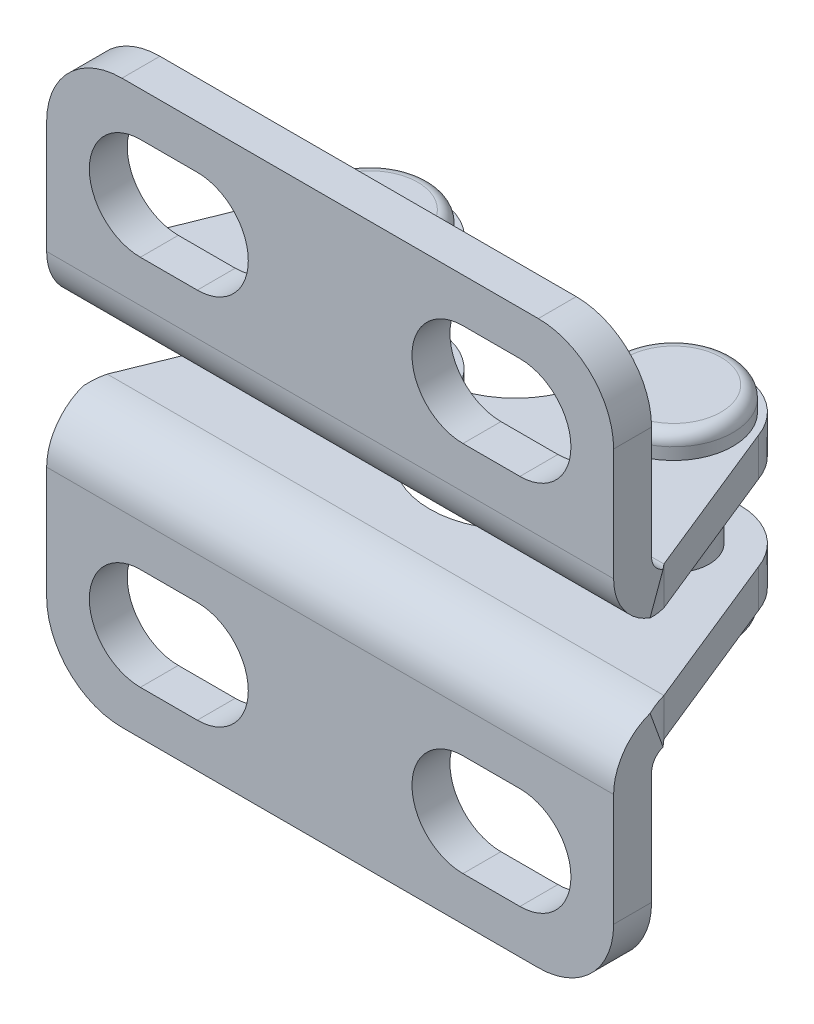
ISO-10303-21;
HEADER;
FILE_DESCRIPTION(('STEP AP214'),'2;1');
FILE_NAME('part.step','',(''),(''),'','','');
FILE_SCHEMA(('AUTOMOTIVE_DESIGN { 1 0 10303 214 1 1 1 1 }'));
ENDSEC;
DATA;
#1=APPLICATION_CONTEXT('core data for automotive mechanical design processes');
#2=APPLICATION_PROTOCOL_DEFINITION('international standard','automotive_design',2000,#1);
#3=PRODUCT_CONTEXT('',#1,'mechanical');
#4=PRODUCT('Part','Part','',(#3));
#5=PRODUCT_RELATED_PRODUCT_CATEGORY('part','',(#4));
#6=PRODUCT_DEFINITION_FORMATION('','',#4);
#7=PRODUCT_DEFINITION_CONTEXT('part definition',#1,'design');
#8=PRODUCT_DEFINITION('design','',#6,#7);
#9=PRODUCT_DEFINITION_SHAPE('','',#8);
#10=(LENGTH_UNIT() NAMED_UNIT(*) SI_UNIT(.MILLI.,.METRE.));
#11=(NAMED_UNIT(*) PLANE_ANGLE_UNIT() SI_UNIT($,.RADIAN.));
#12=(NAMED_UNIT(*) SI_UNIT($,.STERADIAN.) SOLID_ANGLE_UNIT());
#13=UNCERTAINTY_MEASURE_WITH_UNIT(LENGTH_MEASURE(1.E-05),#10,'distance_accuracy_value','');
#14=(GEOMETRIC_REPRESENTATION_CONTEXT(3) GLOBAL_UNCERTAINTY_ASSIGNED_CONTEXT((#13)) GLOBAL_UNIT_ASSIGNED_CONTEXT((#10,
#11,#12)) REPRESENTATION_CONTEXT('',''));
#15=CARTESIAN_POINT('',(0.,0.,0.));
#16=DIRECTION('',(0.,0.,1.));
#17=DIRECTION('',(1.,0.,0.));
#18=AXIS2_PLACEMENT_3D('',#15,#16,#17);
#19=CARTESIAN_POINT('',(-12.8062500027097,-1.60000000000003,-8.08724678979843));
#20=DIRECTION('',(0.,-1.,0.));
#21=DIRECTION('',(0.,0.,1.));
#22=AXIS2_PLACEMENT_3D('',#19,#20,#21);
#23=PLANE('',#22);
#24=DIRECTION('',(0.373507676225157,0.,0.927627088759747));
#25=VECTOR('',#24,1.);
#26=CARTESIAN_POINT('',(2.60810731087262,-1.60000000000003,-9.07483257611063));
#27=LINE('',#26,#25);
#28=CARTESIAN_POINT('',(5.32021694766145,-1.6,-2.33915744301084));
#29=VERTEX_POINT('',#28);
#30=CARTESIAN_POINT('',(5.32124669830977,-1.6,-2.3366));
#31=VERTEX_POINT('',#30);
#32=EDGE_CURVE('E577',#29,#31,#27,.T.);
#33=ORIENTED_EDGE('',*,*,#32,.F.);
#34=DIRECTION('',(0.,0.,1.));
#35=VECTOR('',#34,1.);
#36=CARTESIAN_POINT('',(5.32021694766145,-1.60000000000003,-8.08724678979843));
#37=LINE('',#36,#35);
#38=CARTESIAN_POINT('',(5.32021694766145,-1.60000000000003,-2.33660000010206));
#39=VERTEX_POINT('',#38);
#40=EDGE_CURVE('E357',#29,#39,#37,.T.);
#41=ORIENTED_EDGE('',*,*,#40,.T.);
#42=DIRECTION('',(-1.,0.,0.));
#43=VECTOR('',#42,1.);
#44=CARTESIAN_POINT('',(17.6622975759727,-1.6,-2.3366));
#45=LINE('',#44,#43);
#46=EDGE_CURVE('E453',#31,#39,#45,.T.);
#47=ORIENTED_EDGE('',*,*,#46,.F.);
#48=EDGE_LOOP('',(#33,#41,#47));
#49=FACE_BOUND('',#48,.T.);
#50=ADVANCED_FACE('F16',(#49),#23,.F.);
#51=CARTESIAN_POINT('',(-12.8062500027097,-3.2,-8.08724678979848));
#52=DIRECTION('',(0.,-1.,0.));
#53=DIRECTION('',(0.,0.,1.));
#54=AXIS2_PLACEMENT_3D('',#51,#52,#53);
#55=PLANE('',#54);
#56=DIRECTION('',(0.,0.,1.));
#57=VECTOR('',#56,1.);
#58=CARTESIAN_POINT('',(5.32021694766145,-3.2,-8.08724678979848));
#59=LINE('',#58,#57);
#60=CARTESIAN_POINT('',(5.32021694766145,-3.2,-2.33915744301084));
#61=VERTEX_POINT('',#60);
#62=CARTESIAN_POINT('',(5.32021694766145,-3.2,-2.33660000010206));
#63=VERTEX_POINT('',#62);
#64=EDGE_CURVE('E10',#61,#63,#59,.T.);
#65=ORIENTED_EDGE('',*,*,#64,.F.);
#66=DIRECTION('',(0.373507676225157,0.,0.927627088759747));
#67=VECTOR('',#66,1.);
#68=CARTESIAN_POINT('',(2.60810731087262,-3.2,-9.07483257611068));
#69=LINE('',#68,#67);
#70=CARTESIAN_POINT('',(5.32124669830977,-3.2,-2.3366));
#71=VERTEX_POINT('',#70);
#72=EDGE_CURVE('E602',#71,#61,#69,.F.);
#73=ORIENTED_EDGE('',*,*,#72,.F.);
#74=DIRECTION('',(-1.,0.,0.));
#75=VECTOR('',#74,1.);
#76=CARTESIAN_POINT('',(17.6622975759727,-3.2,-2.3366));
#77=LINE('',#76,#75);
#78=EDGE_CURVE('E598',#71,#63,#77,.T.);
#79=ORIENTED_EDGE('',*,*,#78,.T.);
#80=EDGE_LOOP('',(#65,#73,#79));
#81=FACE_BOUND('',#80,.T.);
#82=ADVANCED_FACE('F539',(#81),#55,.T.);
#83=CARTESIAN_POINT('',(-12.8062500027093,-3.2,-8.08724678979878));
#84=DIRECTION('',(0.,1.,0.));
#85=DIRECTION('',(0.71481216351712,0.,-0.699316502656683));
#86=AXIS2_PLACEMENT_3D('',#83,#84,#85);
#87=CYLINDRICAL_SURFACE('',#86,1.5);
#88=CARTESIAN_POINT('',(-12.8062500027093,1.59999999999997,-8.08724678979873));
#89=DIRECTION('',(0.,1.,0.));
#90=DIRECTION('',(0.,0.,1.));
#91=AXIS2_PLACEMENT_3D('',#88,#89,#90);
#92=CIRCLE('',#91,1.5);
#93=CARTESIAN_POINT('',(-12.8062500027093,1.59999999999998,-6.58724678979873));
#94=VERTEX_POINT('',#93);
#95=EDGE_CURVE('E1071',#94,#94,#92,.F.);
#96=ORIENTED_EDGE('',*,*,#95,.T.);
#97=EDGE_LOOP('',(#96));
#98=FACE_BOUND('',#97,.T.);
#99=CARTESIAN_POINT('',(-12.8062500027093,-1.60000000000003,-8.08724678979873));
#100=DIRECTION('',(0.,-1.,0.));
#101=DIRECTION('',(0.,0.,-1.));
#102=AXIS2_PLACEMENT_3D('',#99,#100,#101);
#103=CIRCLE('',#102,1.5);
#104=CARTESIAN_POINT('',(-12.8062500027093,-1.60000000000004,-9.58724678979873));
#105=VERTEX_POINT('',#104);
#106=EDGE_CURVE('E611',#105,#105,#103,.F.);
#107=ORIENTED_EDGE('',*,*,#106,.T.);
#108=EDGE_LOOP('',(#107));
#109=FACE_BOUND('',#108,.T.);
#110=ADVANCED_FACE('F572',(#98,#109),#87,.T.);
#111=CARTESIAN_POINT('',(-12.8062500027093,4.2,-8.08724678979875));
#112=DIRECTION('',(0.,-1.,0.));
#113=DIRECTION('',(-0.71481216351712,0.,0.699316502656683));
#114=AXIS2_PLACEMENT_3D('',#111,#112,#113);
#115=PLANE('',#114);
#116=CARTESIAN_POINT('',(-12.8062500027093,4.2,-8.08724678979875));
#117=DIRECTION('',(0.,-1.,0.));
#118=DIRECTION('',(-0.714812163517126,0.,0.699316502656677));
#119=AXIS2_PLACEMENT_3D('',#116,#117,#118);
#120=CIRCLE('',#119,1.99999999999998);
#121=CARTESIAN_POINT('',(-14.2358743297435,4.2,-6.68861378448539));
#122=VERTEX_POINT('',#121);
#123=CARTESIAN_POINT('',(-11.3766256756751,4.2,-9.48587979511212));
#124=VERTEX_POINT('',#123);
#125=EDGE_CURVE('E1106',#122,#124,#120,.T.);
#126=ORIENTED_EDGE('',*,*,#125,.F.);
#127=CARTESIAN_POINT('',(-12.8062500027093,4.2,-8.08724678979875));
#128=DIRECTION('',(0.,-1.,0.));
#129=DIRECTION('',(0.714812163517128,0.,-0.699316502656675));
#130=AXIS2_PLACEMENT_3D('',#127,#128,#129);
#131=CIRCLE('',#130,1.99999999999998);
#132=EDGE_CURVE('E44',#124,#122,#131,.T.);
#133=ORIENTED_EDGE('',*,*,#132,.F.);
#134=EDGE_LOOP('',(#126,#133));
#135=FACE_BOUND('',#134,.T.);
#136=ADVANCED_FACE('F540',(#135),#115,.F.);
#137=CARTESIAN_POINT('',(-12.8062500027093,3.7,-8.08724678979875));
#138=DIRECTION('',(0.,-1.,0.));
#139=DIRECTION('',(-0.714812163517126,0.,0.699316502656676));
#140=AXIS2_PLACEMENT_3D('',#137,#138,#139);
#141=TOROIDAL_SURFACE('',#140,1.99999999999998,0.5);
#142=CARTESIAN_POINT('',(-12.8062500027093,3.7,-8.08724678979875));
#143=DIRECTION('',(0.,1.,0.));
#144=DIRECTION('',(0.71481216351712,0.,-0.699316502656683));
#145=AXIS2_PLACEMENT_3D('',#142,#143,#144);
#146=CIRCLE('',#145,2.5);
#147=CARTESIAN_POINT('',(-11.0192195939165,3.69999999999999,-9.83553804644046));
#148=VERTEX_POINT('',#147);
#149=EDGE_CURVE('E1175',#148,#148,#146,.F.);
#150=ORIENTED_EDGE('',*,*,#149,.F.);
#151=EDGE_LOOP('',(#150));
#152=FACE_BOUND('',#151,.T.);
#153=ORIENTED_EDGE('',*,*,#125,.T.);
#154=ORIENTED_EDGE('',*,*,#132,.T.);
#155=EDGE_LOOP('',(#153,#154));
#156=FACE_BOUND('',#155,.T.);
#157=ADVANCED_FACE('F1093',(#152,#156),#141,.T.);
#158=CARTESIAN_POINT('',(-12.8062500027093,3.2,-8.08724678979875));
#159=DIRECTION('',(0.,1.,0.));
#160=DIRECTION('',(0.71481216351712,0.,-0.699316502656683));
#161=AXIS2_PLACEMENT_3D('',#158,#159,#160);
#162=CYLINDRICAL_SURFACE('',#161,2.5);
#163=ORIENTED_EDGE('',*,*,#149,.T.);
#164=EDGE_LOOP('',(#163));
#165=FACE_BOUND('',#164,.T.);
#166=CARTESIAN_POINT('',(-12.8062500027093,3.2,-8.08724678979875));
#167=DIRECTION('',(0.,1.,0.));
#168=DIRECTION('',(0.71481216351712,0.,-0.699316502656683));
#169=AXIS2_PLACEMENT_3D('',#166,#167,#168);
#170=CIRCLE('',#169,2.5);
#171=CARTESIAN_POINT('',(-11.0192195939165,3.19999999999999,-9.83553804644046));
#172=VERTEX_POINT('',#171);
#173=EDGE_CURVE('E1074',#172,#172,#170,.F.);
#174=ORIENTED_EDGE('',*,*,#173,.F.);
#175=EDGE_LOOP('',(#174));
#176=FACE_BOUND('',#175,.T.);
#177=ADVANCED_FACE('F1149',(#165,#176),#162,.T.);
#178=CARTESIAN_POINT('',(-12.8062500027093,-4.2,-8.08724678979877));
#179=DIRECTION('',(0.,-1.,0.));
#180=DIRECTION('',(-0.71481216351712,0.,0.699316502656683));
#181=AXIS2_PLACEMENT_3D('',#178,#179,#180);
#182=PLANE('',#181);
#183=CARTESIAN_POINT('',(-12.8062500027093,-4.20000000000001,-8.08724678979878));
#184=DIRECTION('',(0.,1.,0.));
#185=DIRECTION('',(0.714812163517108,0.,-0.699316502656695));
#186=AXIS2_PLACEMENT_3D('',#183,#184,#185);
#187=CIRCLE('',#186,2.00000000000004);
#188=CARTESIAN_POINT('',(-11.3766256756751,-4.2,-9.48587979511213));
#189=VERTEX_POINT('',#188);
#190=CARTESIAN_POINT('',(-14.2358743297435,-4.2,-6.68861378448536));
#191=VERTEX_POINT('',#190);
#192=EDGE_CURVE('E1036',#189,#191,#187,.T.);
#193=ORIENTED_EDGE('',*,*,#192,.F.);
#194=CARTESIAN_POINT('',(-12.8062500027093,-4.20000000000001,-8.08724678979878));
#195=DIRECTION('',(0.,1.,0.));
#196=DIRECTION('',(-0.714812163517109,0.,0.699316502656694));
#197=AXIS2_PLACEMENT_3D('',#194,#195,#196);
#198=CIRCLE('',#197,2.00000000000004);
#199=EDGE_CURVE('E1161',#191,#189,#198,.T.);
#200=ORIENTED_EDGE('',*,*,#199,.F.);
#201=EDGE_LOOP('',(#193,#200));
#202=FACE_BOUND('',#201,.T.);
#203=ADVANCED_FACE('F1091',(#202),#182,.T.);
#204=CARTESIAN_POINT('',(-12.8062500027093,-3.70000000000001,-8.08724678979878));
#205=DIRECTION('',(0.,-1.,0.));
#206=DIRECTION('',(-0.714812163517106,0.,0.699316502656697));
#207=AXIS2_PLACEMENT_3D('',#204,#205,#206);
#208=TOROIDAL_SURFACE('',#207,2.00000000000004,0.5);
#209=CARTESIAN_POINT('',(-12.8062500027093,-3.7,-8.08724678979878));
#210=DIRECTION('',(0.,1.,0.));
#211=DIRECTION('',(0.71481216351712,0.,-0.699316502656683));
#212=AXIS2_PLACEMENT_3D('',#209,#210,#211);
#213=CIRCLE('',#212,2.5);
#214=CARTESIAN_POINT('',(-11.0192195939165,-3.70000000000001,-9.83553804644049));
#215=VERTEX_POINT('',#214);
#216=EDGE_CURVE('E1104',#215,#215,#213,.T.);
#217=ORIENTED_EDGE('',*,*,#216,.F.);
#218=EDGE_LOOP('',(#217));
#219=FACE_BOUND('',#218,.T.);
#220=ORIENTED_EDGE('',*,*,#199,.T.);
#221=ORIENTED_EDGE('',*,*,#192,.T.);
#222=EDGE_LOOP('',(#220,#221));
#223=FACE_BOUND('',#222,.T.);
#224=ADVANCED_FACE('F1080',(#219,#223),#208,.T.);
#225=CARTESIAN_POINT('',(-12.8062500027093,-4.2,-8.08724678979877));
#226=DIRECTION('',(0.,1.,0.));
#227=DIRECTION('',(0.71481216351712,0.,-0.699316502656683));
#228=AXIS2_PLACEMENT_3D('',#225,#226,#227);
#229=CYLINDRICAL_SURFACE('',#228,2.5);
#230=ORIENTED_EDGE('',*,*,#216,.T.);
#231=EDGE_LOOP('',(#230));
#232=FACE_BOUND('',#231,.T.);
#233=CARTESIAN_POINT('',(-12.8062500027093,-3.2,-8.08724678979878));
#234=DIRECTION('',(0.,1.,0.));
#235=DIRECTION('',(0.71481216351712,0.,-0.699316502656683));
#236=AXIS2_PLACEMENT_3D('',#233,#234,#235);
#237=CIRCLE('',#236,2.5);
#238=CARTESIAN_POINT('',(-11.0192195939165,-3.20000000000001,-9.83553804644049));
#239=VERTEX_POINT('',#238);
#240=EDGE_CURVE('E1172',#239,#239,#237,.F.);
#241=ORIENTED_EDGE('',*,*,#240,.T.);
#242=EDGE_LOOP('',(#241));
#243=FACE_BOUND('',#242,.T.);
#244=ADVANCED_FACE('F791',(#232,#243),#229,.T.);
#245=CARTESIAN_POINT('',(-0.0187500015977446,-4.2,-8.08724678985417));
#246=DIRECTION('',(0.,-1.,0.));
#247=DIRECTION('',(-0.999794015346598,0.,0.0202959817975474));
#248=AXIS2_PLACEMENT_3D('',#245,#246,#247);
#249=PLANE('',#248);
#250=CARTESIAN_POINT('',(-0.0187500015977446,-4.2,-8.08724678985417));
#251=DIRECTION('',(0.,1.,0.));
#252=DIRECTION('',(0.999794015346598,0.,-0.0202959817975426));
#253=AXIS2_PLACEMENT_3D('',#250,#251,#252);
#254=CIRCLE('',#253,2.);
#255=CARTESIAN_POINT('',(1.98083802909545,-4.2,-8.12783875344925));
#256=VERTEX_POINT('',#255);
#257=CARTESIAN_POINT('',(-2.01833803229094,-4.2,-8.04665482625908));
#258=VERTEX_POINT('',#257);
#259=EDGE_CURVE('E871',#256,#258,#254,.T.);
#260=ORIENTED_EDGE('',*,*,#259,.F.);
#261=CARTESIAN_POINT('',(-0.0187500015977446,-4.2,-8.08724678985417));
#262=DIRECTION('',(0.,1.,0.));
#263=DIRECTION('',(-0.999794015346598,0.,0.02029598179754));
#264=AXIS2_PLACEMENT_3D('',#261,#262,#263);
#265=CIRCLE('',#264,2.);
#266=EDGE_CURVE('E815',#258,#256,#265,.T.);
#267=ORIENTED_EDGE('',*,*,#266,.F.);
#268=EDGE_LOOP('',(#260,#267));
#269=FACE_BOUND('',#268,.T.);
#270=ADVANCED_FACE('F787',(#269),#249,.T.);
#271=CARTESIAN_POINT('',(-0.0187500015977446,4.2,-8.08724678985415));
#272=DIRECTION('',(0.,-1.,0.));
#273=DIRECTION('',(-0.999794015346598,0.,0.0202959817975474));
#274=AXIS2_PLACEMENT_3D('',#271,#272,#273);
#275=PLANE('',#274);
#276=CARTESIAN_POINT('',(-0.0187500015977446,4.2,-8.08724678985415));
#277=DIRECTION('',(0.,-1.,0.));
#278=DIRECTION('',(-0.999794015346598,0.,0.0202959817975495));
#279=AXIS2_PLACEMENT_3D('',#276,#277,#278);
#280=CIRCLE('',#279,2.);
#281=CARTESIAN_POINT('',(-2.01833803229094,4.2,-8.04665482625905));
#282=VERTEX_POINT('',#281);
#283=CARTESIAN_POINT('',(1.98083802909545,4.2,-8.12783875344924));
#284=VERTEX_POINT('',#283);
#285=EDGE_CURVE('E842',#282,#284,#280,.T.);
#286=ORIENTED_EDGE('',*,*,#285,.F.);
#287=CARTESIAN_POINT('',(-0.0187500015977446,4.2,-8.08724678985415));
#288=DIRECTION('',(0.,-1.,0.));
#289=DIRECTION('',(0.999794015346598,0.,-0.0202959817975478));
#290=AXIS2_PLACEMENT_3D('',#287,#288,#289);
#291=CIRCLE('',#290,2.);
#292=EDGE_CURVE('E853',#284,#282,#291,.T.);
#293=ORIENTED_EDGE('',*,*,#292,.F.);
#294=EDGE_LOOP('',(#286,#293));
#295=FACE_BOUND('',#294,.T.);
#296=ADVANCED_FACE('F738',(#295),#275,.F.);
#297=CARTESIAN_POINT('',(2.36249999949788,-8.675,-1.6));
#298=DIRECTION('',(0.,0.,1.));
#299=DIRECTION('',(0.,1.,0.));
#300=AXIS2_PLACEMENT_3D('',#297,#298,#299);
#301=CYLINDRICAL_SURFACE('',#300,3.175);
#302=CARTESIAN_POINT('',(2.36249999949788,-8.675,0.));
#303=DIRECTION('',(0.,0.,-1.));
#304=DIRECTION('',(0.,1.,0.));
#305=AXIS2_PLACEMENT_3D('',#302,#303,#304);
#306=CIRCLE('',#305,3.175);
#307=CARTESIAN_POINT('',(5.53749999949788,-8.675,0.));
#308=VERTEX_POINT('',#307);
#309=CARTESIAN_POINT('',(2.36249999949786,-11.85,0.));
#310=VERTEX_POINT('',#309);
#311=EDGE_CURVE('E393',#308,#310,#306,.T.);
#312=ORIENTED_EDGE('',*,*,#311,.T.);
#313=DIRECTION('',(0.,0.,1.));
#314=VECTOR('',#313,1.);
#315=CARTESIAN_POINT('',(2.36249999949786,-11.85,-1.6));
#316=LINE('',#315,#314);
#317=CARTESIAN_POINT('',(2.36249999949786,-11.85,-1.6));
#318=VERTEX_POINT('',#317);
#319=EDGE_CURVE('E424',#318,#310,#316,.T.);
#320=ORIENTED_EDGE('',*,*,#319,.F.);
#321=CARTESIAN_POINT('',(2.36249999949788,-8.675,-1.6));
#322=DIRECTION('',(0.,0.,-1.));
#323=DIRECTION('',(0.,1.,0.));
#324=AXIS2_PLACEMENT_3D('',#321,#322,#323);
#325=CIRCLE('',#324,3.175);
#326=CARTESIAN_POINT('',(5.53749999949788,-8.675,-1.6));
#327=VERTEX_POINT('',#326);
#328=EDGE_CURVE('E400',#327,#318,#325,.T.);
#329=ORIENTED_EDGE('',*,*,#328,.F.);
#330=DIRECTION('',(0.,0.,1.));
#331=VECTOR('',#330,1.);
#332=CARTESIAN_POINT('',(5.53749999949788,-8.675,-1.6));
#333=LINE('',#332,#331);
#334=EDGE_CURVE('E410',#327,#308,#333,.T.);
#335=ORIENTED_EDGE('',*,*,#334,.T.);
#336=EDGE_LOOP('',(#312,#320,#329,#335));
#337=FACE_BOUND('',#336,.T.);
#338=ADVANCED_FACE('F729',(#337),#301,.T.);
#339=CARTESIAN_POINT('',(2.36249999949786,-11.85,-1.6));
#340=DIRECTION('',(0.,1.,0.));
#341=DIRECTION('',(1.,0.,0.));
#342=AXIS2_PLACEMENT_3D('',#339,#340,#341);
#343=PLANE('',#342);
#344=DIRECTION('',(-1.,0.,0.));
#345=VECTOR('',#344,1.);
#346=CARTESIAN_POINT('',(2.36249999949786,-11.85,0.));
#347=LINE('',#346,#345);
#348=CARTESIAN_POINT('',(-15.1875000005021,-11.85,0.));
#349=VERTEX_POINT('',#348);
#350=EDGE_CURVE('E413',#310,#349,#347,.T.);
#351=ORIENTED_EDGE('',*,*,#350,.T.);
#352=DIRECTION('',(0.,0.,1.));
#353=VECTOR('',#352,1.);
#354=CARTESIAN_POINT('',(-15.1875000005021,-11.85,-1.6));
#355=LINE('',#354,#353);
#356=CARTESIAN_POINT('',(-15.1875000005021,-11.85,-1.6));
#357=VERTEX_POINT('',#356);
#358=EDGE_CURVE('E422',#357,#349,#355,.T.);
#359=ORIENTED_EDGE('',*,*,#358,.F.);
#360=DIRECTION('',(-1.,0.,0.));
#361=VECTOR('',#360,1.);
#362=CARTESIAN_POINT('',(2.36249999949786,-11.85,-1.6));
#363=LINE('',#362,#361);
#364=EDGE_CURVE('E403',#318,#357,#363,.T.);
#365=ORIENTED_EDGE('',*,*,#364,.F.);
#366=ORIENTED_EDGE('',*,*,#319,.T.);
#367=EDGE_LOOP('',(#351,#359,#365,#366));
#368=FACE_BOUND('',#367,.T.);
#369=ADVANCED_FACE('F721',(#368),#343,.F.);
#370=CARTESIAN_POINT('',(-12.0125000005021,-7.85,-1.6));
#371=DIRECTION('',(0.,0.,1.));
#372=DIRECTION('',(0.,1.,0.));
#373=AXIS2_PLACEMENT_3D('',#370,#371,#372);
#374=CYLINDRICAL_SURFACE('',#373,2.15);
#375=CARTESIAN_POINT('',(-12.0125000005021,-7.85,0.));
#376=DIRECTION('',(0.,0.,1.));
#377=DIRECTION('',(0.,-1.,0.));
#378=AXIS2_PLACEMENT_3D('',#375,#376,#377);
#379=CIRCLE('',#378,2.15);
#380=CARTESIAN_POINT('',(-12.0125000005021,-10.,0.));
#381=VERTEX_POINT('',#380);
#382=CARTESIAN_POINT('',(-12.0125000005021,-5.7,0.));
#383=VERTEX_POINT('',#382);
#384=EDGE_CURVE('E386',#381,#383,#379,.T.);
#385=ORIENTED_EDGE('',*,*,#384,.T.);
#386=DIRECTION('',(0.,0.,1.));
#387=VECTOR('',#386,1.);
#388=CARTESIAN_POINT('',(-12.0125000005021,-5.7,-1.6));
#389=LINE('',#388,#387);
#390=CARTESIAN_POINT('',(-12.0125000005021,-5.7,-1.6));
#391=VERTEX_POINT('',#390);
#392=EDGE_CURVE('E394',#391,#383,#389,.T.);
#393=ORIENTED_EDGE('',*,*,#392,.F.);
#394=CARTESIAN_POINT('',(-12.0125000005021,-7.85,-1.6));
#395=DIRECTION('',(0.,0.,1.));
#396=DIRECTION('',(0.,-1.,0.));
#397=AXIS2_PLACEMENT_3D('',#394,#395,#396);
#398=CIRCLE('',#397,2.15);
#399=CARTESIAN_POINT('',(-12.0125000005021,-10.,-1.6));
#400=VERTEX_POINT('',#399);
#401=EDGE_CURVE('E375',#400,#391,#398,.T.);
#402=ORIENTED_EDGE('',*,*,#401,.F.);
#403=DIRECTION('',(0.,0.,1.));
#404=VECTOR('',#403,1.);
#405=CARTESIAN_POINT('',(-12.0125000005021,-10.,-1.6));
#406=LINE('',#405,#404);
#407=EDGE_CURVE('E396',#400,#381,#406,.T.);
#408=ORIENTED_EDGE('',*,*,#407,.T.);
#409=EDGE_LOOP('',(#385,#393,#402,#408));
#410=FACE_BOUND('',#409,.T.);
#411=ADVANCED_FACE('F717',(#410),#374,.F.);
#412=CARTESIAN_POINT('',(-12.0125000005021,-5.7,-1.6));
#413=DIRECTION('',(0.,1.,0.));
#414=DIRECTION('',(1.,0.,0.));
#415=AXIS2_PLACEMENT_3D('',#412,#413,#414);
#416=PLANE('',#415);
#417=DIRECTION('',(-1.,0.,0.));
#418=VECTOR('',#417,1.);
#419=CARTESIAN_POINT('',(-12.0125000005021,-5.7,0.));
#420=LINE('',#419,#418);
#421=CARTESIAN_POINT('',(-14.4125000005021,-5.7,0.));
#422=VERTEX_POINT('',#421);
#423=EDGE_CURVE('E372',#383,#422,#420,.T.);
#424=ORIENTED_EDGE('',*,*,#423,.T.);
#425=DIRECTION('',(0.,0.,1.));
#426=VECTOR('',#425,1.);
#427=CARTESIAN_POINT('',(-14.4125000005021,-5.7,-1.6));
#428=LINE('',#427,#426);
#429=CARTESIAN_POINT('',(-14.4125000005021,-5.7,-1.6));
#430=VERTEX_POINT('',#429);
#431=EDGE_CURVE('E391',#430,#422,#428,.T.);
#432=ORIENTED_EDGE('',*,*,#431,.F.);
#433=DIRECTION('',(-1.,0.,0.));
#434=VECTOR('',#433,1.);
#435=CARTESIAN_POINT('',(-12.0125000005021,-5.7,-1.6));
#436=LINE('',#435,#434);
#437=EDGE_CURVE('E378',#391,#430,#436,.T.);
#438=ORIENTED_EDGE('',*,*,#437,.F.);
#439=ORIENTED_EDGE('',*,*,#392,.T.);
#440=EDGE_LOOP('',(#424,#432,#438,#439));
#441=FACE_BOUND('',#440,.T.);
#442=ADVANCED_FACE('F713',(#441),#416,.F.);
#443=CARTESIAN_POINT('',(-14.4125000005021,-7.85,-1.6));
#444=DIRECTION('',(0.,0.,1.));
#445=DIRECTION('',(0.,1.,0.));
#446=AXIS2_PLACEMENT_3D('',#443,#444,#445);
#447=CYLINDRICAL_SURFACE('',#446,2.15);
#448=CARTESIAN_POINT('',(-14.4125000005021,-7.85,0.));
#449=DIRECTION('',(0.,0.,1.));
#450=DIRECTION('',(0.,1.,0.));
#451=AXIS2_PLACEMENT_3D('',#448,#449,#450);
#452=CIRCLE('',#451,2.15);
#453=CARTESIAN_POINT('',(-14.4125000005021,-10.,0.));
#454=VERTEX_POINT('',#453);
#455=EDGE_CURVE('E365',#422,#454,#452,.T.);
#456=ORIENTED_EDGE('',*,*,#455,.T.);
#457=DIRECTION('',(0.,0.,1.));
#458=VECTOR('',#457,1.);
#459=CARTESIAN_POINT('',(-14.4125000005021,-10.,-1.6));
#460=LINE('',#459,#458);
#461=CARTESIAN_POINT('',(-14.4125000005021,-10.,-1.6));
#462=VERTEX_POINT('',#461);
#463=EDGE_CURVE('E381',#462,#454,#460,.T.);
#464=ORIENTED_EDGE('',*,*,#463,.F.);
#465=CARTESIAN_POINT('',(-14.4125000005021,-7.85,-1.6));
#466=DIRECTION('',(0.,0.,1.));
#467=DIRECTION('',(0.,1.,0.));
#468=AXIS2_PLACEMENT_3D('',#465,#466,#467);
#469=CIRCLE('',#468,2.15);
#470=EDGE_CURVE('E368',#430,#462,#469,.T.);
#471=ORIENTED_EDGE('',*,*,#470,.F.);
#472=ORIENTED_EDGE('',*,*,#431,.T.);
#473=EDGE_LOOP('',(#456,#464,#471,#472));
#474=FACE_BOUND('',#473,.T.);
#475=ADVANCED_FACE('F716',(#474),#447,.F.);
#476=CARTESIAN_POINT('',(-14.4125000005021,-10.,-1.6));
#477=DIRECTION('',(0.,-1.,0.));
#478=DIRECTION('',(-1.,0.,0.));
#479=AXIS2_PLACEMENT_3D('',#476,#477,#478);
#480=PLANE('',#479);
#481=DIRECTION('',(1.,0.,0.));
#482=VECTOR('',#481,1.);
#483=CARTESIAN_POINT('',(-14.4125000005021,-10.,0.));
#484=LINE('',#483,#482);
#485=EDGE_CURVE('E383',#454,#381,#484,.T.);
#486=ORIENTED_EDGE('',*,*,#485,.T.);
#487=ORIENTED_EDGE('',*,*,#407,.F.);
#488=DIRECTION('',(1.,0.,0.));
#489=VECTOR('',#488,1.);
#490=CARTESIAN_POINT('',(-14.4125000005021,-10.,-1.6));
#491=LINE('',#490,#489);
#492=EDGE_CURVE('E371',#462,#400,#491,.T.);
#493=ORIENTED_EDGE('',*,*,#492,.F.);
#494=ORIENTED_EDGE('',*,*,#463,.T.);
#495=EDGE_LOOP('',(#486,#487,#493,#494));
#496=FACE_BOUND('',#495,.T.);
#497=ADVANCED_FACE('F707',(#496),#480,.F.);
#498=CARTESIAN_POINT('',(-0.812500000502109,-7.85,-1.6));
#499=DIRECTION('',(0.,0.,1.));
#500=DIRECTION('',(0.,1.,0.));
#501=AXIS2_PLACEMENT_3D('',#498,#499,#500);
#502=CYLINDRICAL_SURFACE('',#501,2.15);
#503=CARTESIAN_POINT('',(-0.812500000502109,-7.85,0.));
#504=DIRECTION('',(0.,0.,1.));
#505=DIRECTION('',(0.,-1.,0.));
#506=AXIS2_PLACEMENT_3D('',#503,#504,#505);
#507=CIRCLE('',#506,2.15);
#508=CARTESIAN_POINT('',(-0.81250000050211,-5.7,0.));
#509=VERTEX_POINT('',#508);
#510=CARTESIAN_POINT('',(-0.812500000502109,-10.,0.));
#511=VERTEX_POINT('',#510);
#512=EDGE_CURVE('E359',#509,#511,#507,.T.);
#513=ORIENTED_EDGE('',*,*,#512,.T.);
#514=DIRECTION('',(0.,0.,1.));
#515=VECTOR('',#514,1.);
#516=CARTESIAN_POINT('',(-0.812500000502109,-10.,-1.6));
#517=LINE('',#516,#515);
#518=CARTESIAN_POINT('',(-0.812500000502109,-10.,-1.6));
#519=VERTEX_POINT('',#518);
#520=EDGE_CURVE('E327',#519,#511,#517,.T.);
#521=ORIENTED_EDGE('',*,*,#520,.F.);
#522=CARTESIAN_POINT('',(-0.812500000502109,-7.85,-1.6));
#523=DIRECTION('',(0.,0.,1.));
#524=DIRECTION('',(0.,-1.,0.));
#525=AXIS2_PLACEMENT_3D('',#522,#523,#524);
#526=CIRCLE('',#525,2.15);
#527=CARTESIAN_POINT('',(-0.81250000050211,-5.7,-1.6));
#528=VERTEX_POINT('',#527);
#529=EDGE_CURVE('E321',#528,#519,#526,.T.);
#530=ORIENTED_EDGE('',*,*,#529,.F.);
#531=DIRECTION('',(0.,0.,1.));
#532=VECTOR('',#531,1.);
#533=CARTESIAN_POINT('',(-0.81250000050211,-5.7,-1.6));
#534=LINE('',#533,#532);
#535=EDGE_CURVE('E325',#528,#509,#534,.T.);
#536=ORIENTED_EDGE('',*,*,#535,.T.);
#537=EDGE_LOOP('',(#513,#521,#530,#536));
#538=FACE_BOUND('',#537,.T.);
#539=ADVANCED_FACE('F324',(#538),#502,.F.);
#540=CARTESIAN_POINT('',(-0.812500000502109,-10.,-1.6));
#541=DIRECTION('',(0.,-1.,0.));
#542=DIRECTION('',(-1.,0.,0.));
#543=AXIS2_PLACEMENT_3D('',#540,#541,#542);
#544=PLANE('',#543);
#545=DIRECTION('',(1.,0.,0.));
#546=VECTOR('',#545,1.);
#547=CARTESIAN_POINT('',(-0.812500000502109,-10.,0.));
#548=LINE('',#547,#546);
#549=CARTESIAN_POINT('',(1.58749999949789,-10.,0.));
#550=VERTEX_POINT('',#549);
#551=EDGE_CURVE('E350',#511,#550,#548,.T.);
#552=ORIENTED_EDGE('',*,*,#551,.T.);
#553=DIRECTION('',(0.,0.,1.));
#554=VECTOR('',#553,1.);
#555=CARTESIAN_POINT('',(1.58749999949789,-10.,-1.6));
#556=LINE('',#555,#554);
#557=CARTESIAN_POINT('',(1.58749999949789,-10.,-1.6));
#558=VERTEX_POINT('',#557);
#559=EDGE_CURVE('E363',#558,#550,#556,.T.);
#560=ORIENTED_EDGE('',*,*,#559,.F.);
#561=DIRECTION('',(1.,0.,0.));
#562=VECTOR('',#561,1.);
#563=CARTESIAN_POINT('',(-0.812500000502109,-10.,-1.6));
#564=LINE('',#563,#562);
#565=EDGE_CURVE('E332',#519,#558,#564,.T.);
#566=ORIENTED_EDGE('',*,*,#565,.F.);
#567=ORIENTED_EDGE('',*,*,#520,.T.);
#568=EDGE_LOOP('',(#552,#560,#566,#567));
#569=FACE_BOUND('',#568,.T.);
#570=ADVANCED_FACE('F695',(#569),#544,.F.);
#571=CARTESIAN_POINT('',(1.58749999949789,-7.85,-1.6));
#572=DIRECTION('',(0.,0.,1.));
#573=DIRECTION('',(0.,1.,0.));
#574=AXIS2_PLACEMENT_3D('',#571,#572,#573);
#575=CYLINDRICAL_SURFACE('',#574,2.15);
#576=CARTESIAN_POINT('',(1.58749999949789,-7.85,0.));
#577=DIRECTION('',(0.,0.,1.));
#578=DIRECTION('',(0.,1.,0.));
#579=AXIS2_PLACEMENT_3D('',#576,#577,#578);
#580=CIRCLE('',#579,2.15);
#581=CARTESIAN_POINT('',(1.58749999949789,-5.7,0.));
#582=VERTEX_POINT('',#581);
#583=EDGE_CURVE('E355',#550,#582,#580,.T.);
#584=ORIENTED_EDGE('',*,*,#583,.T.);
#585=DIRECTION('',(0.,0.,1.));
#586=VECTOR('',#585,1.);
#587=CARTESIAN_POINT('',(1.58749999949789,-5.7,-1.6));
#588=LINE('',#587,#586);
#589=CARTESIAN_POINT('',(1.58749999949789,-5.7,-1.6));
#590=VERTEX_POINT('',#589);
#591=EDGE_CURVE('E343',#590,#582,#588,.T.);
#592=ORIENTED_EDGE('',*,*,#591,.F.);
#593=CARTESIAN_POINT('',(1.58749999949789,-7.85,-1.6));
#594=DIRECTION('',(0.,0.,1.));
#595=DIRECTION('',(0.,1.,0.));
#596=AXIS2_PLACEMENT_3D('',#593,#594,#595);
#597=CIRCLE('',#596,2.15);
#598=EDGE_CURVE('E348',#558,#590,#597,.T.);
#599=ORIENTED_EDGE('',*,*,#598,.F.);
#600=ORIENTED_EDGE('',*,*,#559,.T.);
#601=EDGE_LOOP('',(#584,#592,#599,#600));
#602=FACE_BOUND('',#601,.T.);
#603=ADVANCED_FACE('F703',(#602),#575,.F.);
#604=CARTESIAN_POINT('',(1.58749999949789,-5.7,-1.6));
#605=DIRECTION('',(0.,1.,0.));
#606=DIRECTION('',(1.,0.,0.));
#607=AXIS2_PLACEMENT_3D('',#604,#605,#606);
#608=PLANE('',#607);
#609=DIRECTION('',(-1.,0.,0.));
#610=VECTOR('',#609,1.);
#611=CARTESIAN_POINT('',(1.58749999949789,-5.7,0.));
#612=LINE('',#611,#610);
#613=EDGE_CURVE('E341',#582,#509,#612,.T.);
#614=ORIENTED_EDGE('',*,*,#613,.T.);
#615=ORIENTED_EDGE('',*,*,#535,.F.);
#616=DIRECTION('',(-1.,0.,0.));
#617=VECTOR('',#616,1.);
#618=CARTESIAN_POINT('',(1.58749999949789,-5.7,-1.6));
#619=LINE('',#618,#617);
#620=EDGE_CURVE('E333',#590,#528,#619,.T.);
#621=ORIENTED_EDGE('',*,*,#620,.F.);
#622=ORIENTED_EDGE('',*,*,#591,.T.);
#623=EDGE_LOOP('',(#614,#615,#621,#622));
#624=FACE_BOUND('',#623,.T.);
#625=ADVANCED_FACE('F337',(#624),#608,.F.);
#626=CARTESIAN_POINT('',(-15.1875000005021,-8.675,-1.6));
#627=DIRECTION('',(0.,0.,1.));
#628=DIRECTION('',(0.,1.,0.));
#629=AXIS2_PLACEMENT_3D('',#626,#627,#628);
#630=CYLINDRICAL_SURFACE('',#629,3.175);
#631=CARTESIAN_POINT('',(-15.1875000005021,-8.675,0.));
#632=DIRECTION('',(0.,0.,-1.));
#633=DIRECTION('',(0.,1.,0.));
#634=AXIS2_PLACEMENT_3D('',#631,#632,#633);
#635=CIRCLE('',#634,3.175);
#636=CARTESIAN_POINT('',(-18.3625000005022,-8.675,0.));
#637=VERTEX_POINT('',#636);
#638=EDGE_CURVE('E404',#349,#637,#635,.T.);
#639=ORIENTED_EDGE('',*,*,#638,.T.);
#640=DIRECTION('',(0.,0.,1.));
#641=VECTOR('',#640,1.);
#642=CARTESIAN_POINT('',(-18.3625000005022,-8.675,-1.6));
#643=LINE('',#642,#641);
#644=CARTESIAN_POINT('',(-18.3625000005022,-8.675,-1.6));
#645=VERTEX_POINT('',#644);
#646=EDGE_CURVE('E418',#645,#637,#643,.T.);
#647=ORIENTED_EDGE('',*,*,#646,.F.);
#648=CARTESIAN_POINT('',(-15.1875000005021,-8.675,-1.6));
#649=DIRECTION('',(0.,0.,-1.));
#650=DIRECTION('',(0.,1.,0.));
#651=AXIS2_PLACEMENT_3D('',#648,#649,#650);
#652=CIRCLE('',#651,3.175);
#653=EDGE_CURVE('E407',#357,#645,#652,.T.);
#654=ORIENTED_EDGE('',*,*,#653,.F.);
#655=ORIENTED_EDGE('',*,*,#358,.T.);
#656=EDGE_LOOP('',(#639,#647,#654,#655));
#657=FACE_BOUND('',#656,.T.);
#658=ADVANCED_FACE('F533',(#657),#630,.T.);
#659=CARTESIAN_POINT('',(-15.1875000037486,8.675,-1.59999999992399));
#660=DIRECTION('',(8.68555082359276E-12,0.,1.));
#661=DIRECTION('',(0.,-1.,0.));
#662=AXIS2_PLACEMENT_3D('',#659,#660,#661);
#663=CYLINDRICAL_SURFACE('',#662,3.175);
#664=CARTESIAN_POINT('',(-15.1875000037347,8.675,7.60110290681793E-11));
#665=DIRECTION('',(-8.68555082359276E-12,0.,-1.));
#666=DIRECTION('',(0.,-1.,0.));
#667=AXIS2_PLACEMENT_3D('',#664,#665,#666);
#668=CIRCLE('',#667,3.175);
#669=CARTESIAN_POINT('',(-18.3625000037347,8.675,1.03587711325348E-10));
#670=VERTEX_POINT('',#669);
#671=CARTESIAN_POINT('',(-15.1875000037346,11.85,7.59889113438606E-11));
#672=VERTEX_POINT('',#671);
#673=EDGE_CURVE('E949',#670,#672,#668,.T.);
#674=ORIENTED_EDGE('',*,*,#673,.T.);
#675=DIRECTION('',(8.68555082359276E-12,0.,1.));
#676=VECTOR('',#675,1.);
#677=CARTESIAN_POINT('',(-15.1875000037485,11.85,-1.59999999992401));
#678=LINE('',#677,#676);
#679=CARTESIAN_POINT('',(-15.1875000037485,11.85,-1.59999999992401));
#680=VERTEX_POINT('',#679);
#681=EDGE_CURVE('E944',#680,#672,#678,.T.);
#682=ORIENTED_EDGE('',*,*,#681,.F.);
#683=CARTESIAN_POINT('',(-15.1875000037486,8.675,-1.59999999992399));
#684=DIRECTION('',(-8.68555082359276E-12,0.,-1.));
#685=DIRECTION('',(0.,-1.,0.));
#686=AXIS2_PLACEMENT_3D('',#683,#684,#685);
#687=CIRCLE('',#686,3.175);
#688=CARTESIAN_POINT('',(-18.3625000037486,8.675,-1.59999999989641));
#689=VERTEX_POINT('',#688);
#690=EDGE_CURVE('E945',#689,#680,#687,.T.);
#691=ORIENTED_EDGE('',*,*,#690,.F.);
#692=DIRECTION('',(8.68555082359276E-12,0.,1.));
#693=VECTOR('',#692,1.);
#694=CARTESIAN_POINT('',(-18.3625000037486,8.675,-1.59999999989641));
#695=LINE('',#694,#693);
#696=EDGE_CURVE('E884',#689,#670,#695,.T.);
#697=ORIENTED_EDGE('',*,*,#696,.T.);
#698=EDGE_LOOP('',(#674,#682,#691,#697));
#699=FACE_BOUND('',#698,.T.);
#700=ADVANCED_FACE('F732',(#699),#663,.T.);
#701=CARTESIAN_POINT('',(-15.1875000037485,11.85,-1.59999999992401));
#702=DIRECTION('',(0.,-1.,0.));
#703=DIRECTION('',(-1.,0.,8.68555082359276E-12));
#704=AXIS2_PLACEMENT_3D('',#701,#702,#703);
#705=PLANE('',#704);
#706=DIRECTION('',(1.,0.,-8.68555082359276E-12));
#707=VECTOR('',#706,1.);
#708=CARTESIAN_POINT('',(-15.1875000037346,11.85,7.59889113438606E-11));
#709=LINE('',#708,#707);
#710=CARTESIAN_POINT('',(2.3624999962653,11.85,-7.64425415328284E-11));
#711=VERTEX_POINT('',#710);
#712=EDGE_CURVE('E952',#672,#711,#709,.T.);
#713=ORIENTED_EDGE('',*,*,#712,.T.);
#714=DIRECTION('',(8.68555082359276E-12,0.,1.));
#715=VECTOR('',#714,1.);
#716=CARTESIAN_POINT('',(2.36249999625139,11.85,-1.60000000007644));
#717=LINE('',#716,#715);
#718=CARTESIAN_POINT('',(2.36249999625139,11.85,-1.60000000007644));
#719=VERTEX_POINT('',#718);
#720=EDGE_CURVE('E963',#719,#711,#717,.T.);
#721=ORIENTED_EDGE('',*,*,#720,.F.);
#722=DIRECTION('',(1.,0.,-8.68555082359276E-12));
#723=VECTOR('',#722,1.);
#724=CARTESIAN_POINT('',(-15.1875000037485,11.85,-1.59999999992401));
#725=LINE('',#724,#723);
#726=EDGE_CURVE('E941',#680,#719,#725,.T.);
#727=ORIENTED_EDGE('',*,*,#726,.F.);
#728=ORIENTED_EDGE('',*,*,#681,.T.);
#729=EDGE_LOOP('',(#713,#721,#727,#728));
#730=FACE_BOUND('',#729,.T.);
#731=ADVANCED_FACE('F765',(#730),#705,.F.);
#732=CARTESIAN_POINT('',(-0.812500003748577,7.85,-1.60000000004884));
#733=DIRECTION('',(8.68555082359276E-12,0.,1.));
#734=DIRECTION('',(0.,-1.,0.));
#735=AXIS2_PLACEMENT_3D('',#732,#733,#734);
#736=CYLINDRICAL_SURFACE('',#735,2.15);
#737=CARTESIAN_POINT('',(-0.81250000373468,7.85,-4.88378868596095E-11));
#738=DIRECTION('',(8.68555082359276E-12,0.,1.));
#739=DIRECTION('',(0.,1.,0.));
#740=AXIS2_PLACEMENT_3D('',#737,#738,#739);
#741=CIRCLE('',#740,2.15);
#742=CARTESIAN_POINT('',(-0.81250000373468,10.,-4.885284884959E-11));
#743=VERTEX_POINT('',#742);
#744=CARTESIAN_POINT('',(-0.812500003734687,5.7,-4.88229248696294E-11));
#745=VERTEX_POINT('',#744);
#746=EDGE_CURVE('E993',#743,#745,#741,.T.);
#747=ORIENTED_EDGE('',*,*,#746,.T.);
#748=DIRECTION('',(8.68555082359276E-12,0.,1.));
#749=VECTOR('',#748,1.);
#750=CARTESIAN_POINT('',(-0.812500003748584,5.7,-1.60000000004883));
#751=LINE('',#750,#749);
#752=CARTESIAN_POINT('',(-0.812500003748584,5.7,-1.60000000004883));
#753=VERTEX_POINT('',#752);
#754=EDGE_CURVE('E987',#753,#745,#751,.T.);
#755=ORIENTED_EDGE('',*,*,#754,.F.);
#756=CARTESIAN_POINT('',(-0.812500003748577,7.85,-1.60000000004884));
#757=DIRECTION('',(8.68555082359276E-12,0.,1.));
#758=DIRECTION('',(0.,1.,0.));
#759=AXIS2_PLACEMENT_3D('',#756,#757,#758);
#760=CIRCLE('',#759,2.15);
#761=CARTESIAN_POINT('',(-0.812500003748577,10.,-1.60000000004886));
#762=VERTEX_POINT('',#761);
#763=EDGE_CURVE('E1003',#762,#753,#760,.T.);
#764=ORIENTED_EDGE('',*,*,#763,.F.);
#765=DIRECTION('',(8.68555082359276E-12,0.,1.));
#766=VECTOR('',#765,1.);
#767=CARTESIAN_POINT('',(-0.812500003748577,10.,-1.60000000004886));
#768=LINE('',#767,#766);
#769=EDGE_CURVE('E984',#762,#743,#768,.T.);
#770=ORIENTED_EDGE('',*,*,#769,.T.);
#771=EDGE_LOOP('',(#747,#755,#764,#770));
#772=FACE_BOUND('',#771,.T.);
#773=ADVANCED_FACE('F784',(#772),#736,.F.);
#774=CARTESIAN_POINT('',(-0.812500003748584,5.7,-1.60000000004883));
#775=DIRECTION('',(0.,-1.,0.));
#776=DIRECTION('',(-1.,0.,8.68555082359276E-12));
#777=AXIS2_PLACEMENT_3D('',#774,#775,#776);
#778=PLANE('',#777);
#779=DIRECTION('',(1.,0.,-8.68555082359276E-12));
#780=VECTOR('',#779,1.);
#781=CARTESIAN_POINT('',(-0.812500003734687,5.7,-4.88229248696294E-11));
#782=LINE('',#781,#780);
#783=CARTESIAN_POINT('',(1.58749999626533,5.7,-6.96682295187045E-11));
#784=VERTEX_POINT('',#783);
#785=EDGE_CURVE('E990',#745,#784,#782,.T.);
#786=ORIENTED_EDGE('',*,*,#785,.T.);
#787=DIRECTION('',(8.68555082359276E-12,0.,1.));
#788=VECTOR('',#787,1.);
#789=CARTESIAN_POINT('',(1.58749999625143,5.7,-1.60000000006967));
#790=LINE('',#789,#788);
#791=CARTESIAN_POINT('',(1.58749999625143,5.7,-1.60000000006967));
#792=VERTEX_POINT('',#791);
#793=EDGE_CURVE('E953',#792,#784,#790,.T.);
#794=ORIENTED_EDGE('',*,*,#793,.F.);
#795=DIRECTION('',(1.,0.,-8.68555082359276E-12));
#796=VECTOR('',#795,1.);
#797=CARTESIAN_POINT('',(-0.812500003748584,5.7,-1.60000000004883));
#798=LINE('',#797,#796);
#799=EDGE_CURVE('E985',#753,#792,#798,.T.);
#800=ORIENTED_EDGE('',*,*,#799,.F.);
#801=ORIENTED_EDGE('',*,*,#754,.T.);
#802=EDGE_LOOP('',(#786,#794,#800,#801));
#803=FACE_BOUND('',#802,.T.);
#804=ADVANCED_FACE('F1571',(#803),#778,.F.);
#805=CARTESIAN_POINT('',(1.58749999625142,7.85,-1.60000000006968));
#806=DIRECTION('',(8.68555082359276E-12,0.,1.));
#807=DIRECTION('',(0.,-1.,0.));
#808=AXIS2_PLACEMENT_3D('',#805,#806,#807);
#809=CYLINDRICAL_SURFACE('',#808,2.15);
#810=CARTESIAN_POINT('',(1.58749999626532,7.85,-6.96831915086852E-11));
#811=DIRECTION('',(8.68555082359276E-12,0.,1.));
#812=DIRECTION('',(0.,-1.,0.));
#813=AXIS2_PLACEMENT_3D('',#810,#811,#812);
#814=CIRCLE('',#813,2.15);
#815=CARTESIAN_POINT('',(1.58749999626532,10.,-6.96981534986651E-11));
#816=VERTEX_POINT('',#815);
#817=EDGE_CURVE('E999',#784,#816,#814,.T.);
#818=ORIENTED_EDGE('',*,*,#817,.T.);
#819=DIRECTION('',(8.68555082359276E-12,0.,1.));
#820=VECTOR('',#819,1.);
#821=CARTESIAN_POINT('',(1.58749999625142,10.,-1.6000000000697));
#822=LINE('',#821,#820);
#823=CARTESIAN_POINT('',(1.58749999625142,10.,-1.6000000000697));
#824=VERTEX_POINT('',#823);
#825=EDGE_CURVE('E981',#824,#816,#822,.T.);
#826=ORIENTED_EDGE('',*,*,#825,.F.);
#827=CARTESIAN_POINT('',(1.58749999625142,7.85,-1.60000000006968));
#828=DIRECTION('',(8.68555082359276E-12,0.,1.));
#829=DIRECTION('',(0.,-1.,0.));
#830=AXIS2_PLACEMENT_3D('',#827,#828,#829);
#831=CIRCLE('',#830,2.15);
#832=EDGE_CURVE('E933',#792,#824,#831,.T.);
#833=ORIENTED_EDGE('',*,*,#832,.F.);
#834=ORIENTED_EDGE('',*,*,#793,.T.);
#835=EDGE_LOOP('',(#818,#826,#833,#834));
#836=FACE_BOUND('',#835,.T.);
#837=ADVANCED_FACE('F781',(#836),#809,.F.);
#838=CARTESIAN_POINT('',(1.58749999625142,10.,-1.6000000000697));
#839=DIRECTION('',(0.,1.,0.));
#840=DIRECTION('',(1.,0.,-8.68555082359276E-12));
#841=AXIS2_PLACEMENT_3D('',#838,#839,#840);
#842=PLANE('',#841);
#843=DIRECTION('',(-1.,0.,8.68555082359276E-12));
#844=VECTOR('',#843,1.);
#845=CARTESIAN_POINT('',(1.58749999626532,10.,-6.96981534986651E-11));
#846=LINE('',#845,#844);
#847=EDGE_CURVE('E996',#816,#743,#846,.T.);
#848=ORIENTED_EDGE('',*,*,#847,.T.);
#849=ORIENTED_EDGE('',*,*,#769,.F.);
#850=DIRECTION('',(-1.,0.,8.68555082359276E-12));
#851=VECTOR('',#850,1.);
#852=CARTESIAN_POINT('',(1.58749999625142,10.,-1.6000000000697));
#853=LINE('',#852,#851);
#854=EDGE_CURVE('E1006',#824,#762,#853,.T.);
#855=ORIENTED_EDGE('',*,*,#854,.F.);
#856=ORIENTED_EDGE('',*,*,#825,.T.);
#857=EDGE_LOOP('',(#848,#849,#855,#856));
#858=FACE_BOUND('',#857,.T.);
#859=ADVANCED_FACE('F769',(#858),#842,.F.);
#860=CARTESIAN_POINT('',(-12.0125000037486,7.85,-1.59999999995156));
#861=DIRECTION('',(8.68555082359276E-12,0.,1.));
#862=DIRECTION('',(0.,-1.,0.));
#863=AXIS2_PLACEMENT_3D('',#860,#861,#862);
#864=CYLINDRICAL_SURFACE('',#863,2.15);
#865=CARTESIAN_POINT('',(-12.0125000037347,7.85,4.84402015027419E-11));
#866=DIRECTION('',(8.68555082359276E-12,0.,1.));
#867=DIRECTION('',(0.,1.,0.));
#868=AXIS2_PLACEMENT_3D('',#865,#866,#867);
#869=CIRCLE('',#868,2.15);
#870=CARTESIAN_POINT('',(-12.0125000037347,5.7,4.8455163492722E-11));
#871=VERTEX_POINT('',#870);
#872=CARTESIAN_POINT('',(-12.0125000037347,10.,4.84252395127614E-11));
#873=VERTEX_POINT('',#872);
#874=EDGE_CURVE('E1021',#871,#873,#869,.T.);
#875=ORIENTED_EDGE('',*,*,#874,.T.);
#876=DIRECTION('',(8.68555082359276E-12,0.,1.));
#877=VECTOR('',#876,1.);
#878=CARTESIAN_POINT('',(-12.0125000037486,10.,-1.59999999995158));
#879=LINE('',#878,#877);
#880=CARTESIAN_POINT('',(-12.0125000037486,10.,-1.59999999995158));
#881=VERTEX_POINT('',#880);
#882=EDGE_CURVE('E1015',#881,#873,#879,.T.);
#883=ORIENTED_EDGE('',*,*,#882,.F.);
#884=CARTESIAN_POINT('',(-12.0125000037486,7.85,-1.59999999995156));
#885=DIRECTION('',(8.68555082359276E-12,0.,1.));
#886=DIRECTION('',(0.,1.,0.));
#887=AXIS2_PLACEMENT_3D('',#884,#885,#886);
#888=CIRCLE('',#887,2.15);
#889=CARTESIAN_POINT('',(-12.0125000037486,5.7,-1.59999999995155));
#890=VERTEX_POINT('',#889);
#891=EDGE_CURVE('E1027',#890,#881,#888,.T.);
#892=ORIENTED_EDGE('',*,*,#891,.F.);
#893=DIRECTION('',(8.68555082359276E-12,0.,1.));
#894=VECTOR('',#893,1.);
#895=CARTESIAN_POINT('',(-12.0125000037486,5.7,-1.59999999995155));
#896=LINE('',#895,#894);
#897=EDGE_CURVE('E1012',#890,#871,#896,.T.);
#898=ORIENTED_EDGE('',*,*,#897,.T.);
#899=EDGE_LOOP('',(#875,#883,#892,#898));
#900=FACE_BOUND('',#899,.T.);
#901=ADVANCED_FACE('F757',(#900),#864,.F.);
#902=CARTESIAN_POINT('',(-12.0125000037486,10.,-1.59999999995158));
#903=DIRECTION('',(0.,1.,0.));
#904=DIRECTION('',(1.,0.,-8.68555082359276E-12));
#905=AXIS2_PLACEMENT_3D('',#902,#903,#904);
#906=PLANE('',#905);
#907=DIRECTION('',(-1.,0.,8.68555082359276E-12));
#908=VECTOR('',#907,1.);
#909=CARTESIAN_POINT('',(-12.0125000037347,10.,4.84252395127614E-11));
#910=LINE('',#909,#908);
#911=CARTESIAN_POINT('',(-14.4125000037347,10.,6.92705441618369E-11));
#912=VERTEX_POINT('',#911);
#913=EDGE_CURVE('E1018',#873,#912,#910,.T.);
#914=ORIENTED_EDGE('',*,*,#913,.T.);
#915=DIRECTION('',(8.68555082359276E-12,0.,1.));
#916=VECTOR('',#915,1.);
#917=CARTESIAN_POINT('',(-14.4125000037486,10.,-1.59999999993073));
#918=LINE('',#917,#916);
#919=CARTESIAN_POINT('',(-14.4125000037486,10.,-1.59999999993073));
#920=VERTEX_POINT('',#919);
#921=EDGE_CURVE('E1001',#920,#912,#918,.T.);
#922=ORIENTED_EDGE('',*,*,#921,.F.);
#923=DIRECTION('',(-1.,0.,8.68555082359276E-12));
#924=VECTOR('',#923,1.);
#925=CARTESIAN_POINT('',(-12.0125000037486,10.,-1.59999999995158));
#926=LINE('',#925,#924);
#927=EDGE_CURVE('E1013',#881,#920,#926,.T.);
#928=ORIENTED_EDGE('',*,*,#927,.F.);
#929=ORIENTED_EDGE('',*,*,#882,.T.);
#930=EDGE_LOOP('',(#914,#922,#928,#929));
#931=FACE_BOUND('',#930,.T.);
#932=ADVANCED_FACE('F766',(#931),#906,.F.);
#933=CARTESIAN_POINT('',(-14.4125000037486,7.85,-1.59999999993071));
#934=DIRECTION('',(8.68555082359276E-12,0.,1.));
#935=DIRECTION('',(0.,-1.,0.));
#936=AXIS2_PLACEMENT_3D('',#933,#934,#935);
#937=CYLINDRICAL_SURFACE('',#936,2.15);
#938=CARTESIAN_POINT('',(-14.4125000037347,7.85,6.92855061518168E-11));
#939=DIRECTION('',(8.68555082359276E-12,0.,1.));
#940=DIRECTION('',(0.,-1.,0.));
#941=AXIS2_PLACEMENT_3D('',#938,#939,#940);
#942=CIRCLE('',#941,2.15);
#943=CARTESIAN_POINT('',(-14.4125000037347,5.7,6.93004681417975E-11));
#944=VERTEX_POINT('',#943);
#945=EDGE_CURVE('E430',#912,#944,#942,.T.);
#946=ORIENTED_EDGE('',*,*,#945,.T.);
#947=DIRECTION('',(8.68555082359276E-12,0.,1.));
#948=VECTOR('',#947,1.);
#949=CARTESIAN_POINT('',(-14.4125000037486,5.7,-1.5999999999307));
#950=LINE('',#949,#948);
#951=CARTESIAN_POINT('',(-14.4125000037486,5.7,-1.5999999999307));
#952=VERTEX_POINT('',#951);
#953=EDGE_CURVE('E1009',#952,#944,#950,.T.);
#954=ORIENTED_EDGE('',*,*,#953,.F.);
#955=CARTESIAN_POINT('',(-14.4125000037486,7.85,-1.59999999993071));
#956=DIRECTION('',(8.68555082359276E-12,0.,1.));
#957=DIRECTION('',(0.,-1.,0.));
#958=AXIS2_PLACEMENT_3D('',#955,#956,#957);
#959=CIRCLE('',#958,2.15);
#960=EDGE_CURVE('E927',#920,#952,#959,.T.);
#961=ORIENTED_EDGE('',*,*,#960,.F.);
#962=ORIENTED_EDGE('',*,*,#921,.T.);
#963=EDGE_LOOP('',(#946,#954,#961,#962));
#964=FACE_BOUND('',#963,.T.);
#965=ADVANCED_FACE('F754',(#964),#937,.F.);
#966=CARTESIAN_POINT('',(-14.4125000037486,5.7,-1.5999999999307));
#967=DIRECTION('',(0.,-1.,0.));
#968=DIRECTION('',(-1.,0.,8.68555082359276E-12));
#969=AXIS2_PLACEMENT_3D('',#966,#967,#968);
#970=PLANE('',#969);
#971=DIRECTION('',(1.,0.,-8.68555082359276E-12));
#972=VECTOR('',#971,1.);
#973=CARTESIAN_POINT('',(-14.4125000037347,5.7,6.93004681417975E-11));
#974=LINE('',#973,#972);
#975=EDGE_CURVE('E1023',#944,#871,#974,.T.);
#976=ORIENTED_EDGE('',*,*,#975,.T.);
#977=ORIENTED_EDGE('',*,*,#897,.F.);
#978=DIRECTION('',(1.,0.,-8.68555082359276E-12));
#979=VECTOR('',#978,1.);
#980=CARTESIAN_POINT('',(-14.4125000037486,5.7,-1.5999999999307));
#981=LINE('',#980,#979);
#982=EDGE_CURVE('E1030',#952,#890,#981,.T.);
#983=ORIENTED_EDGE('',*,*,#982,.F.);
#984=ORIENTED_EDGE('',*,*,#953,.T.);
#985=EDGE_LOOP('',(#976,#977,#983,#984));
#986=FACE_BOUND('',#985,.T.);
#987=ADVANCED_FACE('F743',(#986),#970,.F.);
#988=CARTESIAN_POINT('',(2.36249999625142,8.675,-1.60000000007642));
#989=DIRECTION('',(8.68555082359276E-12,0.,1.));
#990=DIRECTION('',(0.,-1.,0.));
#991=AXIS2_PLACEMENT_3D('',#988,#989,#990);
#992=CYLINDRICAL_SURFACE('',#991,3.175);
#993=CARTESIAN_POINT('',(2.36249999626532,8.675,-7.64204238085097E-11));
#994=DIRECTION('',(-8.68555082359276E-12,0.,-1.));
#995=DIRECTION('',(0.,-1.,0.));
#996=AXIS2_PLACEMENT_3D('',#993,#994,#995);
#997=CIRCLE('',#996,3.175);
#998=CARTESIAN_POINT('',(5.53749999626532,8.675,-1.03997106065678E-10));
#999=VERTEX_POINT('',#998);
#1000=EDGE_CURVE('E956',#711,#999,#997,.T.);
#1001=ORIENTED_EDGE('',*,*,#1000,.T.);
#1002=DIRECTION('',(8.68555082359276E-12,0.,1.));
#1003=VECTOR('',#1002,1.);
#1004=CARTESIAN_POINT('',(5.53749999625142,8.675,-1.600000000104));
#1005=LINE('',#1004,#1003);
#1006=CARTESIAN_POINT('',(5.53749999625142,8.675,-1.600000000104));
#1007=VERTEX_POINT('',#1006);
#1008=EDGE_CURVE('E959',#1007,#999,#1005,.T.);
#1009=ORIENTED_EDGE('',*,*,#1008,.F.);
#1010=CARTESIAN_POINT('',(2.36249999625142,8.675,-1.60000000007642));
#1011=DIRECTION('',(-8.68555082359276E-12,0.,-1.));
#1012=DIRECTION('',(0.,-1.,0.));
#1013=AXIS2_PLACEMENT_3D('',#1010,#1011,#1012);
#1014=CIRCLE('',#1013,3.175);
#1015=EDGE_CURVE('E938',#719,#1007,#1014,.T.);
#1016=ORIENTED_EDGE('',*,*,#1015,.F.);
#1017=ORIENTED_EDGE('',*,*,#720,.T.);
#1018=EDGE_LOOP('',(#1001,#1009,#1016,#1017));
#1019=FACE_BOUND('',#1018,.T.);
#1020=ADVANCED_FACE('F676',(#1019),#992,.T.);
#1021=CARTESIAN_POINT('',(-12.8062500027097,4.22773242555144,-1.6));
#1022=DIRECTION('',(0.,0.,-1.));
#1023=DIRECTION('',(0.,-1.,0.));
#1024=AXIS2_PLACEMENT_3D('',#1021,#1022,#1023);
#1025=PLANE('',#1024);
#1026=ORIENTED_EDGE('',*,*,#598,.T.);
#1027=ORIENTED_EDGE('',*,*,#620,.T.);
#1028=ORIENTED_EDGE('',*,*,#529,.T.);
#1029=ORIENTED_EDGE('',*,*,#565,.T.);
#1030=EDGE_LOOP('',(#1026,#1027,#1028,#1029));
#1031=FACE_BOUND('',#1030,.T.);
#1032=ORIENTED_EDGE('',*,*,#470,.T.);
#1033=ORIENTED_EDGE('',*,*,#492,.T.);
#1034=ORIENTED_EDGE('',*,*,#401,.T.);
#1035=ORIENTED_EDGE('',*,*,#437,.T.);
#1036=EDGE_LOOP('',(#1032,#1033,#1034,#1035));
#1037=FACE_BOUND('',#1036,.T.);
#1038=ORIENTED_EDGE('',*,*,#653,.T.);
#1039=DIRECTION('',(0.,1.,0.));
#1040=VECTOR('',#1039,1.);
#1041=CARTESIAN_POINT('',(-18.3625000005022,-8.61230608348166,-1.6));
#1042=LINE('',#1041,#1040);
#1043=CARTESIAN_POINT('',(-18.3625000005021,-3.9366,-1.6));
#1044=VERTEX_POINT('',#1043);
#1045=EDGE_CURVE('E443',#1044,#645,#1042,.F.);
#1046=ORIENTED_EDGE('',*,*,#1045,.F.);
#1047=DIRECTION('',(-1.,0.,0.));
#1048=VECTOR('',#1047,1.);
#1049=CARTESIAN_POINT('',(-12.8062500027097,-3.9366,-1.6));
#1050=LINE('',#1049,#1048);
#1051=CARTESIAN_POINT('',(5.53749999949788,-3.9366,-1.6));
#1052=VERTEX_POINT('',#1051);
#1053=EDGE_CURVE('E440',#1044,#1052,#1050,.F.);
#1054=ORIENTED_EDGE('',*,*,#1053,.T.);
#1055=DIRECTION('',(0.,-1.,0.));
#1056=VECTOR('',#1055,1.);
#1057=CARTESIAN_POINT('',(5.53749999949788,-2.0599914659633,-1.6));
#1058=LINE('',#1057,#1056);
#1059=EDGE_CURVE('E435',#327,#1052,#1058,.F.);
#1060=ORIENTED_EDGE('',*,*,#1059,.F.);
#1061=ORIENTED_EDGE('',*,*,#328,.T.);
#1062=ORIENTED_EDGE('',*,*,#364,.T.);
#1063=EDGE_LOOP('',(#1038,#1046,#1054,#1060,#1061,#1062));
#1064=FACE_BOUND('',#1063,.T.);
#1065=ADVANCED_FACE('F345',(#1031,#1037,#1064),#1025,.T.);
#1066=CARTESIAN_POINT('',(-0.0187500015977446,-3.7,-8.08724678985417));
#1067=DIRECTION('',(0.,-1.,0.));
#1068=DIRECTION('',(-0.999794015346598,0.,0.0202959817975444));
#1069=AXIS2_PLACEMENT_3D('',#1066,#1067,#1068);
#1070=TOROIDAL_SURFACE('',#1069,2.,0.5);
#1071=CARTESIAN_POINT('',(-0.0187500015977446,-3.7,-8.08724678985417));
#1072=DIRECTION('',(0.,1.,0.));
#1073=DIRECTION('',(0.999794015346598,0.,-0.0202959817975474));
#1074=AXIS2_PLACEMENT_3D('',#1071,#1072,#1073);
#1075=CIRCLE('',#1074,2.5);
#1076=CARTESIAN_POINT('',(2.48073503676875,-3.7,-8.13798674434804));
#1077=VERTEX_POINT('',#1076);
#1078=EDGE_CURVE('E838',#1077,#1077,#1075,.T.);
#1079=ORIENTED_EDGE('',*,*,#1078,.F.);
#1080=EDGE_LOOP('',(#1079));
#1081=FACE_BOUND('',#1080,.T.);
#1082=ORIENTED_EDGE('',*,*,#266,.T.);
#1083=ORIENTED_EDGE('',*,*,#259,.T.);
#1084=EDGE_LOOP('',(#1082,#1083));
#1085=FACE_BOUND('',#1084,.T.);
#1086=ADVANCED_FACE('F793',(#1081,#1085),#1070,.T.);
#1087=CARTESIAN_POINT('',(-0.0187500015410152,-4.22773242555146,-1.60000000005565));
#1088=DIRECTION('',(-8.68555082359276E-12,0.,-1.));
#1089=DIRECTION('',(0.,1.,0.));
#1090=AXIS2_PLACEMENT_3D('',#1087,#1088,#1089);
#1091=PLANE('',#1090);
#1092=ORIENTED_EDGE('',*,*,#960,.T.);
#1093=ORIENTED_EDGE('',*,*,#982,.T.);
#1094=ORIENTED_EDGE('',*,*,#891,.T.);
#1095=ORIENTED_EDGE('',*,*,#927,.T.);
#1096=EDGE_LOOP('',(#1092,#1093,#1094,#1095));
#1097=FACE_BOUND('',#1096,.T.);
#1098=ORIENTED_EDGE('',*,*,#832,.T.);
#1099=ORIENTED_EDGE('',*,*,#854,.T.);
#1100=ORIENTED_EDGE('',*,*,#763,.T.);
#1101=ORIENTED_EDGE('',*,*,#799,.T.);
#1102=EDGE_LOOP('',(#1098,#1099,#1100,#1101));
#1103=FACE_BOUND('',#1102,.T.);
#1104=ORIENTED_EDGE('',*,*,#1015,.T.);
#1105=DIRECTION('',(0.,-1.,0.));
#1106=VECTOR('',#1105,1.);
#1107=CARTESIAN_POINT('',(5.53749999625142,8.61230608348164,-1.600000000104));
#1108=LINE('',#1107,#1106);
#1109=CARTESIAN_POINT('',(5.53749999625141,3.9366,-1.60000000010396));
#1110=VERTEX_POINT('',#1109);
#1111=EDGE_CURVE('E629',#1110,#1007,#1108,.F.);
#1112=ORIENTED_EDGE('',*,*,#1111,.F.);
#1113=DIRECTION('',(1.,0.,-8.68555082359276E-12));
#1114=VECTOR('',#1113,1.);
#1115=CARTESIAN_POINT('',(-0.0187500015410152,3.9366,-1.6000000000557));
#1116=LINE('',#1115,#1114);
#1117=CARTESIAN_POINT('',(-18.3625000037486,3.9366,-1.59999999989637));
#1118=VERTEX_POINT('',#1117);
#1119=EDGE_CURVE('E632',#1110,#1118,#1116,.F.);
#1120=ORIENTED_EDGE('',*,*,#1119,.T.);
#1121=DIRECTION('',(0.,1.,0.));
#1122=VECTOR('',#1121,1.);
#1123=CARTESIAN_POINT('',(-18.3625000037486,2.05999146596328,-1.59999999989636));
#1124=LINE('',#1123,#1122);
#1125=EDGE_CURVE('E887',#689,#1118,#1124,.F.);
#1126=ORIENTED_EDGE('',*,*,#1125,.F.);
#1127=ORIENTED_EDGE('',*,*,#690,.T.);
#1128=ORIENTED_EDGE('',*,*,#726,.T.);
#1129=EDGE_LOOP('',(#1104,#1112,#1120,#1126,#1127,#1128));
#1130=FACE_BOUND('',#1129,.T.);
#1131=ADVANCED_FACE('F694',(#1097,#1103,#1130),#1091,.T.);
#1132=CARTESIAN_POINT('',(-0.0187500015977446,3.7,-8.08724678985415));
#1133=DIRECTION('',(0.,-1.,0.));
#1134=DIRECTION('',(-0.999794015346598,0.,0.0202959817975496));
#1135=AXIS2_PLACEMENT_3D('',#1132,#1133,#1134);
#1136=TOROIDAL_SURFACE('',#1135,2.,0.5);
#1137=CARTESIAN_POINT('',(-0.0187500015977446,3.7,-8.08724678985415));
#1138=DIRECTION('',(0.,1.,0.));
#1139=DIRECTION('',(0.999794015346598,0.,-0.0202959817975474));
#1140=AXIS2_PLACEMENT_3D('',#1137,#1138,#1139);
#1141=CIRCLE('',#1140,2.5);
#1142=CARTESIAN_POINT('',(2.48073503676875,3.7,-8.13798674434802));
#1143=VERTEX_POINT('',#1142);
#1144=EDGE_CURVE('E1058',#1143,#1143,#1141,.F.);
#1145=ORIENTED_EDGE('',*,*,#1144,.F.);
#1146=EDGE_LOOP('',(#1145));
#1147=FACE_BOUND('',#1146,.T.);
#1148=ORIENTED_EDGE('',*,*,#285,.T.);
#1149=ORIENTED_EDGE('',*,*,#292,.T.);
#1150=EDGE_LOOP('',(#1148,#1149));
#1151=FACE_BOUND('',#1150,.T.);
#1152=ADVANCED_FACE('F750',(#1147,#1151),#1136,.T.);
#1153=CARTESIAN_POINT('',(5.53749999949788,-2.0599914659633,0.));
#1154=DIRECTION('',(1.,0.,0.));
#1155=DIRECTION('',(0.,-1.,0.));
#1156=AXIS2_PLACEMENT_3D('',#1153,#1154,#1155);
#1157=PLANE('',#1156);
#1158=DIRECTION('',(0.,-1.,0.));
#1159=VECTOR('',#1158,1.);
#1160=CARTESIAN_POINT('',(5.53749999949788,4.22773242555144,0.));
#1161=LINE('',#1160,#1159);
#1162=CARTESIAN_POINT('',(5.53749999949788,-3.9366,0.));
#1163=VERTEX_POINT('',#1162);
#1164=EDGE_CURVE('E428',#1163,#308,#1161,.T.);
#1165=ORIENTED_EDGE('',*,*,#1164,.T.);
#1166=ORIENTED_EDGE('',*,*,#334,.F.);
#1167=ORIENTED_EDGE('',*,*,#1059,.T.);
#1168=CARTESIAN_POINT('',(5.53749999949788,-3.9366,-2.3366));
#1169=DIRECTION('',(-1.,0.,0.));
#1170=DIRECTION('',(0.,1.,0.));
#1171=AXIS2_PLACEMENT_3D('',#1168,#1169,#1170);
#1172=CIRCLE('',#1171,0.7366);
#1173=CARTESIAN_POINT('',(5.53749999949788,-3.24453766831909,-2.08435153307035));
#1174=VERTEX_POINT('',#1173);
#1175=EDGE_CURVE('E494',#1052,#1174,#1172,.T.);
#1176=ORIENTED_EDGE('',*,*,#1175,.T.);
#1177=DIRECTION('',(0.,-0.939536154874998,-0.342449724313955));
#1178=VECTOR('',#1177,1.);
#1179=CARTESIAN_POINT('',(5.53749999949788,-2.49290874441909,-1.81039175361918));
#1180=LINE('',#1179,#1178);
#1181=CARTESIAN_POINT('',(5.53749999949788,-1.7412798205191,-1.53643197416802));
#1182=VERTEX_POINT('',#1181);
#1183=EDGE_CURVE('E491',#1182,#1174,#1180,.T.);
#1184=ORIENTED_EDGE('',*,*,#1183,.F.);
#1185=CARTESIAN_POINT('',(5.53749999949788,-3.9366,-2.3366));
#1186=DIRECTION('',(-1.,0.,0.));
#1187=DIRECTION('',(0.,1.,0.));
#1188=AXIS2_PLACEMENT_3D('',#1185,#1186,#1187);
#1189=CIRCLE('',#1188,2.3366);
#1190=EDGE_CURVE('E480',#1163,#1182,#1189,.T.);
#1191=ORIENTED_EDGE('',*,*,#1190,.F.);
#1192=EDGE_LOOP('',(#1165,#1166,#1167,#1176,#1184,#1191));
#1193=FACE_BOUND('',#1192,.T.);
#1194=ADVANCED_FACE('F469',(#1193),#1157,.T.);
#1195=CARTESIAN_POINT('',(-12.8062500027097,4.22773242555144,0.));
#1196=DIRECTION('',(0.,0.,-1.));
#1197=DIRECTION('',(0.,-1.,0.));
#1198=AXIS2_PLACEMENT_3D('',#1195,#1196,#1197);
#1199=PLANE('',#1198);
#1200=ORIENTED_EDGE('',*,*,#613,.F.);
#1201=ORIENTED_EDGE('',*,*,#583,.F.);
#1202=ORIENTED_EDGE('',*,*,#551,.F.);
#1203=ORIENTED_EDGE('',*,*,#512,.F.);
#1204=EDGE_LOOP('',(#1200,#1201,#1202,#1203));
#1205=FACE_BOUND('',#1204,.T.);
#1206=ORIENTED_EDGE('',*,*,#485,.F.);
#1207=ORIENTED_EDGE('',*,*,#455,.F.);
#1208=ORIENTED_EDGE('',*,*,#423,.F.);
#1209=ORIENTED_EDGE('',*,*,#384,.F.);
#1210=EDGE_LOOP('',(#1206,#1207,#1208,#1209));
#1211=FACE_BOUND('',#1210,.T.);
#1212=DIRECTION('',(0.,-1.,0.));
#1213=VECTOR('',#1212,1.);
#1214=CARTESIAN_POINT('',(-18.3625000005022,4.22773242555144,0.));
#1215=LINE('',#1214,#1213);
#1216=CARTESIAN_POINT('',(-18.3625000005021,-3.9366,0.));
#1217=VERTEX_POINT('',#1216);
#1218=EDGE_CURVE('E432',#637,#1217,#1215,.F.);
#1219=ORIENTED_EDGE('',*,*,#1218,.F.);
#1220=ORIENTED_EDGE('',*,*,#638,.F.);
#1221=ORIENTED_EDGE('',*,*,#350,.F.);
#1222=ORIENTED_EDGE('',*,*,#311,.F.);
#1223=ORIENTED_EDGE('',*,*,#1164,.F.);
#1224=DIRECTION('',(-1.,0.,0.));
#1225=VECTOR('',#1224,1.);
#1226=CARTESIAN_POINT('',(-12.8062500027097,-3.9366,0.));
#1227=LINE('',#1226,#1225);
#1228=EDGE_CURVE('E431',#1217,#1163,#1227,.F.);
#1229=ORIENTED_EDGE('',*,*,#1228,.F.);
#1230=EDGE_LOOP('',(#1219,#1220,#1221,#1222,#1223,#1229));
#1231=FACE_BOUND('',#1230,.T.);
#1232=ADVANCED_FACE('F740',(#1205,#1211,#1231),#1199,.F.);
#1233=CARTESIAN_POINT('',(-18.3625000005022,-8.61230608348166,0.));
#1234=DIRECTION('',(-1.,0.,0.));
#1235=DIRECTION('',(0.,1.,0.));
#1236=AXIS2_PLACEMENT_3D('',#1233,#1234,#1235);
#1237=PLANE('',#1236);
#1238=ORIENTED_EDGE('',*,*,#1045,.T.);
#1239=ORIENTED_EDGE('',*,*,#646,.T.);
#1240=ORIENTED_EDGE('',*,*,#1218,.T.);
#1241=CARTESIAN_POINT('',(-18.3625000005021,-3.9366,-2.3366));
#1242=DIRECTION('',(-1.,0.,0.));
#1243=DIRECTION('',(0.,1.,0.));
#1244=AXIS2_PLACEMENT_3D('',#1241,#1242,#1243);
#1245=CIRCLE('',#1244,2.3366);
#1246=CARTESIAN_POINT('',(-18.3625000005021,-1.7412798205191,-1.53643197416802));
#1247=VERTEX_POINT('',#1246);
#1248=EDGE_CURVE('E439',#1247,#1217,#1245,.F.);
#1249=ORIENTED_EDGE('',*,*,#1248,.F.);
#1250=DIRECTION('',(0.,-0.939536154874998,-0.342449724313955));
#1251=VECTOR('',#1250,1.);
#1252=CARTESIAN_POINT('',(-18.3625000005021,-1.7412798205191,-1.53643197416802));
#1253=LINE('',#1252,#1251);
#1254=CARTESIAN_POINT('',(-18.3625000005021,-3.24453766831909,-2.08435153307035));
#1255=VERTEX_POINT('',#1254);
#1256=EDGE_CURVE('E445',#1247,#1255,#1253,.T.);
#1257=ORIENTED_EDGE('',*,*,#1256,.T.);
#1258=CARTESIAN_POINT('',(-18.3625000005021,-3.9366,-2.3366));
#1259=DIRECTION('',(-1.,0.,0.));
#1260=DIRECTION('',(0.,1.,0.));
#1261=AXIS2_PLACEMENT_3D('',#1258,#1259,#1260);
#1262=CIRCLE('',#1261,0.7366);
#1263=EDGE_CURVE('E444',#1255,#1044,#1262,.F.);
#1264=ORIENTED_EDGE('',*,*,#1263,.T.);
#1265=EDGE_LOOP('',(#1238,#1239,#1240,#1249,#1257,#1264));
#1266=FACE_BOUND('',#1265,.T.);
#1267=ADVANCED_FACE('F468',(#1266),#1237,.T.);
#1268=CARTESIAN_POINT('',(-18.1452169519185,-1.584,-2.3366));
#1269=CARTESIAN_POINT('',(-18.2176710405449,-1.584,-2.06240433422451));
#1270=CARTESIAN_POINT('',(-18.2900459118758,-1.6323490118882,-1.78856952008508));
#1271=CARTESIAN_POINT('',(-18.3625000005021,-1.7262472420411,-1.53095277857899));
#1272=CARTESIAN_POINT('',(-18.1452169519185,-1.6,-2.3366));
#1273=CARTESIAN_POINT('',(-18.2176709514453,-1.6,-2.06426924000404));
#1274=CARTESIAN_POINT('',(-18.2900460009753,-1.64802022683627,-1.7922965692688));
#1275=CARTESIAN_POINT('',(-18.3625000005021,-1.7412798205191,-1.53643197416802));
#1276=CARTESIAN_POINT('',(-18.1452169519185,-3.2,-2.3366));
#1277=CARTESIAN_POINT('',(-18.2176620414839,-3.2,-2.25075981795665));
#1278=CARTESIAN_POINT('',(-18.2900549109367,-3.21514172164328,-2.16500148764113));
#1279=CARTESIAN_POINT('',(-18.3625000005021,-3.24453766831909,-2.08435153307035));
#1280=B_SPLINE_SURFACE_WITH_KNOTS('',1,3,((#1268,#1269,#1270,#1271),(#1272,#1273,#1274,#1275),
(#1276,#1277,#1278,#1279)),.UNSPECIFIED.,.F.,.F.,.F.,(2,1,2),(4,4),(-0.01,0.,1.),(0.,1.),.UNSPECIFIED.);
#1281=CARTESIAN_POINT('',(-18.1452169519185,-1.6,-2.33660000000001));
#1282=CARTESIAN_POINT('',(-18.1542704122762,-1.59999949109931,-2.30257099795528));
#1283=CARTESIAN_POINT('',(-18.1633238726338,-1.60074335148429,-2.26854203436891));
#1284=CARTESIAN_POINT('',(-18.1814307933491,-1.60371615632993,-2.20054903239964));
#1285=CARTESIAN_POINT('',(-18.1904842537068,-1.60594510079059,-2.16658499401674));
#1286=CARTESIAN_POINT('',(-18.2085911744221,-1.61188441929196,-2.0987866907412));
#1287=CARTESIAN_POINT('',(-18.2176446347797,-1.61559479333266,-2.06495242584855));
#1288=CARTESIAN_POINT('',(-18.235751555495,-1.6244897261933,-1.99747823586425));
#1289=CARTESIAN_POINT('',(-18.2448050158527,-1.62967428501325,-1.96383831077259));
#1290=CARTESIAN_POINT('',(-18.262911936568,-1.64150774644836,-1.89681700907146));
#1291=CARTESIAN_POINT('',(-18.2719653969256,-1.64815664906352,-1.86343563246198));
#1292=CARTESIAN_POINT('',(-18.2900723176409,-1.66290605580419,-1.79699512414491));
#1293=CARTESIAN_POINT('',(-18.2991257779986,-1.6710065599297,-1.76393599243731));
#1294=CARTESIAN_POINT('',(-18.3172326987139,-1.68864386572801,-1.69820311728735));
#1295=CARTESIAN_POINT('',(-18.3262861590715,-1.69818066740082,-1.66552937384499));
#1296=CARTESIAN_POINT('',(-18.3443930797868,-1.71867179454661,-1.60062945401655));
#1297=CARTESIAN_POINT('',(-18.3534465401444,-1.72962612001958,-1.56840327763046));
#1298=CARTESIAN_POINT('',(-18.3625000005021,-1.74127982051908,-1.53643197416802));
#1299=B_SPLINE_CURVE_WITH_KNOTS('',3,(#1281,#1282,#1283,#1284,#1285,#1286,#1287,#1288,#1289,
#1290,#1291,#1292,#1293,#1294,#1295,#1296,#1297,#1298),.UNSPECIFIED.,.F.,.F.,(4,2,2,2,2,2,2,2,
4),(0.,0.10563035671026,0.211260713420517,0.316891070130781,0.422521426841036,0.528151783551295,
0.633782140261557,0.739412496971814,0.845042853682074),.UNSPECIFIED.);
#1300=CARTESIAN_POINT('',(-18.1452169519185,-1.6,-2.3366));
#1301=VERTEX_POINT('',#1300);
#1302=EDGE_CURVE('E449',#1301,#1247,#1299,.T.);
#1303=DIRECTION('',(0.,-1.,0.));
#1304=VECTOR('',#1303,1.);
#1305=CARTESIAN_POINT('',(-18.1452169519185,-1.6,-2.3366));
#1306=LINE('',#1305,#1304);
#1307=CARTESIAN_POINT('',(-18.1452169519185,-3.2,-2.3366));
#1308=VERTEX_POINT('',#1307);
#1309=EDGE_CURVE('E607',#1308,#1301,#1306,.F.);
#1310=CARTESIAN_POINT('',(-18.1452169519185,-3.2,-2.3366));
#1311=CARTESIAN_POINT('',(-18.1542704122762,-3.19999983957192,-2.32587254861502));
#1312=CARTESIAN_POINT('',(-18.1633238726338,-3.20023433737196,-2.31514510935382));
#1313=CARTESIAN_POINT('',(-18.1814307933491,-3.2011714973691,-2.29371069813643));
#1314=CARTESIAN_POINT('',(-18.1904842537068,-3.20187415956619,-2.28300372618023));
#1315=CARTESIAN_POINT('',(-18.2085911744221,-3.20374649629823,-2.2616306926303));
#1316=CARTESIAN_POINT('',(-18.2176446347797,-3.20491617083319,-2.25096463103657));
#1317=CARTESIAN_POINT('',(-18.235751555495,-3.20772024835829,-2.22969377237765));
#1318=CARTESIAN_POINT('',(-18.2448050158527,-3.20935465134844,-2.21908897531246));
#1319=CARTESIAN_POINT('',(-18.262911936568,-3.21308508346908,-2.19796088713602));
#1320=CARTESIAN_POINT('',(-18.2719653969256,-3.21518111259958,-2.18743759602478));
#1321=CARTESIAN_POINT('',(-18.2900723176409,-3.21983078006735,-2.16649259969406));
#1322=CARTESIAN_POINT('',(-18.2991257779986,-3.22238441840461,-2.15607089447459));
#1323=CARTESIAN_POINT('',(-18.3172326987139,-3.22794447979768,-2.13534897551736));
#1324=CARTESIAN_POINT('',(-18.3262861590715,-3.23095090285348,-2.1250487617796));
#1325=CARTESIAN_POINT('',(-18.3443930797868,-3.2374106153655,-2.10458942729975));
#1326=CARTESIAN_POINT('',(-18.3534465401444,-3.24086390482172,-2.09443030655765));
#1327=CARTESIAN_POINT('',(-18.3625000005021,-3.24453766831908,-2.08435153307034));
#1328=B_SPLINE_CURVE_WITH_KNOTS('',3,(#1310,#1311,#1312,#1313,#1314,#1315,#1316,#1317,#1318,
#1319,#1320,#1321,#1322,#1323,#1324,#1325,#1326,#1327),.UNSPECIFIED.,.F.,.F.,(4,2,2,2,2,2,2,2,
4),(0.,0.0421096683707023,0.0842193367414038,0.126329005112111,0.168438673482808,
0.210548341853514,0.252658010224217,0.294767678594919,0.336877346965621),.UNSPECIFIED.);
#1329=EDGE_CURVE('E448',#1308,#1255,#1328,.T.);
#1330=ORIENTED_EDGE('',*,*,#1256,.F.);
#1331=ORIENTED_EDGE('',*,*,#1302,.F.);
#1332=ORIENTED_EDGE('',*,*,#1309,.F.);
#1333=ORIENTED_EDGE('',*,*,#1329,.T.);
#1334=EDGE_LOOP('',(#1330,#1331,#1332,#1333));
#1335=FACE_BOUND('',#1334,.T.);
#1336=ADVANCED_FACE('F18',(#1335),#1280,.T.);
#1337=CARTESIAN_POINT('',(5.53749999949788,-1.7262472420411,-1.53095277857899));
#1338=CARTESIAN_POINT('',(5.46538927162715,-1.63234899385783,-1.78856956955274));
#1339=CARTESIAN_POINT('',(5.3933574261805,-1.584,-2.06240428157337));
#1340=CARTESIAN_POINT('',(5.32124669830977,-1.584,-2.3366));
#1341=CARTESIAN_POINT('',(5.53749999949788,-1.7412798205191,-1.53643197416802));
#1342=CARTESIAN_POINT('',(5.46538935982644,-1.64802020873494,-1.79229661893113));
#1343=CARTESIAN_POINT('',(5.39335733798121,-1.6,-2.0642691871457));
#1344=CARTESIAN_POINT('',(5.32124669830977,-1.6,-2.3366));
#1345=CARTESIAN_POINT('',(5.53749999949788,-3.24453766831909,-2.08435153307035));
#1346=CARTESIAN_POINT('',(5.46539817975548,-3.21514169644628,-2.16500155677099));
#1347=CARTESIAN_POINT('',(5.39334851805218,-3.2,-2.25075974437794));
#1348=CARTESIAN_POINT('',(5.32124669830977,-3.2,-2.3366));
#1349=B_SPLINE_SURFACE_WITH_KNOTS('',1,3,((#1337,#1338,#1339,#1340),(#1341,#1342,#1343,#1344),
(#1345,#1346,#1347,#1348)),.UNSPECIFIED.,.F.,.F.,.F.,(2,1,2),(4,4),(-0.01,0.,1.),(0.,1.),.UNSPECIFIED.);
#1350=DIRECTION('',(0.,1.,0.));
#1351=VECTOR('',#1350,1.);
#1352=CARTESIAN_POINT('',(5.32124669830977,-2.4,-2.3366));
#1353=LINE('',#1352,#1351);
#1354=EDGE_CURVE('E482',#71,#31,#1353,.T.);
#1355=CARTESIAN_POINT('',(5.53749999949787,-1.74127982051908,-1.53643197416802));
#1356=CARTESIAN_POINT('',(5.5284894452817,-1.72962612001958,-1.56840327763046));
#1357=CARTESIAN_POINT('',(5.51947889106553,-1.71867179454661,-1.60062945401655));
#1358=CARTESIAN_POINT('',(5.50145778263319,-1.69818066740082,-1.66552937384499));
#1359=CARTESIAN_POINT('',(5.49244722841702,-1.68864386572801,-1.69820311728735));
#1360=CARTESIAN_POINT('',(5.47442611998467,-1.6710065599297,-1.76393599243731));
#1361=CARTESIAN_POINT('',(5.4654155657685,-1.66290605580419,-1.79699512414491));
#1362=CARTESIAN_POINT('',(5.44739445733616,-1.64815664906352,-1.86343563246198));
#1363=CARTESIAN_POINT('',(5.43838390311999,-1.64150774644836,-1.89681700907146));
#1364=CARTESIAN_POINT('',(5.42036279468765,-1.62967428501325,-1.96383831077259));
#1365=CARTESIAN_POINT('',(5.41135224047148,-1.6244897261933,-1.99747823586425));
#1366=CARTESIAN_POINT('',(5.39333113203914,-1.61559479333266,-2.06495242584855));
#1367=CARTESIAN_POINT('',(5.38432057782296,-1.61188441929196,-2.0987866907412));
#1368=CARTESIAN_POINT('',(5.36629946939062,-1.60594510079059,-2.16658499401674));
#1369=CARTESIAN_POINT('',(5.35728891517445,-1.60371615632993,-2.20054903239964));
#1370=CARTESIAN_POINT('',(5.33926780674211,-1.60074335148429,-2.26854203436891));
#1371=CARTESIAN_POINT('',(5.33025725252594,-1.59999949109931,-2.30257099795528));
#1372=CARTESIAN_POINT('',(5.32124669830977,-1.6,-2.33660000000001));
#1373=B_SPLINE_CURVE_WITH_KNOTS('',3,(#1355,#1356,#1357,#1358,#1359,#1360,#1361,#1362,#1363,
#1364,#1365,#1366,#1367,#1368,#1369,#1370,#1371,#1372),.UNSPECIFIED.,.F.,.F.,(4,2,2,2,2,2,2,2,
4),(0.,0.105597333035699,0.211194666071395,0.316791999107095,0.422389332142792,
0.527986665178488,0.633583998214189,0.739181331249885,0.844778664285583),.UNSPECIFIED.);
#1374=EDGE_CURVE('E474',#1182,#31,#1373,.T.);
#1375=CARTESIAN_POINT('',(5.53749999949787,-3.24453766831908,-2.08435153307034));
#1376=CARTESIAN_POINT('',(5.5284894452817,-3.24086390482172,-2.09443030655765));
#1377=CARTESIAN_POINT('',(5.51947889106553,-3.2374106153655,-2.10458942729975));
#1378=CARTESIAN_POINT('',(5.50145778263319,-3.23095090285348,-2.1250487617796));
#1379=CARTESIAN_POINT('',(5.49244722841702,-3.22794447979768,-2.13534897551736));
#1380=CARTESIAN_POINT('',(5.47442611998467,-3.22238441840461,-2.15607089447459));
#1381=CARTESIAN_POINT('',(5.4654155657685,-3.21983078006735,-2.16649259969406));
#1382=CARTESIAN_POINT('',(5.44739445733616,-3.21518111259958,-2.18743759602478));
#1383=CARTESIAN_POINT('',(5.43838390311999,-3.21308508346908,-2.19796088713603));
#1384=CARTESIAN_POINT('',(5.42036279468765,-3.20935465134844,-2.21908897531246));
#1385=CARTESIAN_POINT('',(5.41135224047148,-3.20772024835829,-2.22969377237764));
#1386=CARTESIAN_POINT('',(5.39333113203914,-3.20491617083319,-2.25096463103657));
#1387=CARTESIAN_POINT('',(5.38432057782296,-3.20374649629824,-2.2616306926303));
#1388=CARTESIAN_POINT('',(5.36629946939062,-3.20187415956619,-2.28300372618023));
#1389=CARTESIAN_POINT('',(5.35728891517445,-3.2011714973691,-2.29371069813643));
#1390=CARTESIAN_POINT('',(5.33926780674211,-3.20023433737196,-2.31514510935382));
#1391=CARTESIAN_POINT('',(5.33025725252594,-3.19999983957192,-2.32587254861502));
#1392=CARTESIAN_POINT('',(5.32124669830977,-3.2,-2.3366));
#1393=B_SPLINE_CURVE_WITH_KNOTS('',3,(#1375,#1376,#1377,#1378,#1379,#1380,#1381,#1382,#1383,
#1384,#1385,#1386,#1387,#1388,#1389,#1390,#1391,#1392),.UNSPECIFIED.,.F.,.F.,(4,2,2,2,2,2,2,2,
4),(0.,0.0420267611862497,0.0840535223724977,0.126080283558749,0.168107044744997,
0.210133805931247,0.252160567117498,0.294187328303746,0.336214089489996),.UNSPECIFIED.);
#1394=EDGE_CURVE('E490',#1174,#71,#1393,.T.);
#1395=ORIENTED_EDGE('',*,*,#1354,.T.);
#1396=ORIENTED_EDGE('',*,*,#1374,.F.);
#1397=ORIENTED_EDGE('',*,*,#1183,.T.);
#1398=ORIENTED_EDGE('',*,*,#1394,.T.);
#1399=EDGE_LOOP('',(#1395,#1396,#1397,#1398));
#1400=FACE_BOUND('',#1399,.T.);
#1401=ADVANCED_FACE('F515',(#1400),#1349,.T.);
#1402=CARTESIAN_POINT('',(-18.3625000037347,2.0599914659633,1.03633898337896E-10));
#1403=DIRECTION('',(-1.,0.,8.68555082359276E-12));
#1404=DIRECTION('',(0.,1.,0.));
#1405=AXIS2_PLACEMENT_3D('',#1402,#1403,#1404);
#1406=PLANE('',#1405);
#1407=DIRECTION('',(0.,1.,0.));
#1408=VECTOR('',#1407,1.);
#1409=CARTESIAN_POINT('',(-18.3625000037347,-4.22773242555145,1.03677916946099E-10));
#1410=LINE('',#1409,#1408);
#1411=CARTESIAN_POINT('',(-18.3625000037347,3.9366,1.03620887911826E-10));
#1412=VERTEX_POINT('',#1411);
#1413=EDGE_CURVE('E873',#1412,#670,#1410,.T.);
#1414=ORIENTED_EDGE('',*,*,#1413,.T.);
#1415=ORIENTED_EDGE('',*,*,#696,.F.);
#1416=ORIENTED_EDGE('',*,*,#1125,.T.);
#1417=CARTESIAN_POINT('',(-18.362500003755,3.9366,-2.33659999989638));
#1418=DIRECTION('',(1.,0.,-8.68555082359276E-12));
#1419=DIRECTION('',(0.,-1.,0.));
#1420=AXIS2_PLACEMENT_3D('',#1417,#1418,#1419);
#1421=CIRCLE('',#1420,0.7366);
#1422=CARTESIAN_POINT('',(-18.3625000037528,3.24453766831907,-2.08435153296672));
#1423=VERTEX_POINT('',#1422);
#1424=EDGE_CURVE('E628',#1118,#1423,#1421,.T.);
#1425=ORIENTED_EDGE('',*,*,#1424,.T.);
#1426=DIRECTION('',(-2.97436448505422E-12,0.939536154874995,-0.342449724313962));
#1427=VECTOR('',#1426,1.);
#1428=CARTESIAN_POINT('',(-18.3625000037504,2.49290874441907,-1.81039175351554));
#1429=LINE('',#1428,#1427);
#1430=CARTESIAN_POINT('',(-18.362500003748,1.74127982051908,-1.53643197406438));
#1431=VERTEX_POINT('',#1430);
#1432=EDGE_CURVE('E625',#1431,#1423,#1429,.T.);
#1433=ORIENTED_EDGE('',*,*,#1432,.F.);
#1434=CARTESIAN_POINT('',(-18.362500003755,3.9366,-2.33659999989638));
#1435=DIRECTION('',(1.,0.,-8.68555082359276E-12));
#1436=DIRECTION('',(0.,-1.,0.));
#1437=AXIS2_PLACEMENT_3D('',#1434,#1435,#1436);
#1438=CIRCLE('',#1437,2.3366);
#1439=EDGE_CURVE('E631',#1412,#1431,#1438,.T.);
#1440=ORIENTED_EDGE('',*,*,#1439,.F.);
#1441=EDGE_LOOP('',(#1414,#1415,#1416,#1425,#1433,#1440));
#1442=FACE_BOUND('',#1441,.T.);
#1443=ADVANCED_FACE('F545',(#1442),#1406,.T.);
#1444=CARTESIAN_POINT('',(-0.0187500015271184,-4.22773242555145,-5.56477607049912E-11));
#1445=DIRECTION('',(-8.68555082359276E-12,0.,-1.));
#1446=DIRECTION('',(0.,1.,0.));
#1447=AXIS2_PLACEMENT_3D('',#1444,#1445,#1446);
#1448=PLANE('',#1447);
#1449=ORIENTED_EDGE('',*,*,#975,.F.);
#1450=ORIENTED_EDGE('',*,*,#945,.F.);
#1451=ORIENTED_EDGE('',*,*,#913,.F.);
#1452=ORIENTED_EDGE('',*,*,#874,.F.);
#1453=EDGE_LOOP('',(#1449,#1450,#1451,#1452));
#1454=FACE_BOUND('',#1453,.T.);
#1455=ORIENTED_EDGE('',*,*,#847,.F.);
#1456=ORIENTED_EDGE('',*,*,#817,.F.);
#1457=ORIENTED_EDGE('',*,*,#785,.F.);
#1458=ORIENTED_EDGE('',*,*,#746,.F.);
#1459=EDGE_LOOP('',(#1455,#1456,#1457,#1458));
#1460=FACE_BOUND('',#1459,.T.);
#1461=DIRECTION('',(0.,1.,0.));
#1462=VECTOR('',#1461,1.);
#1463=CARTESIAN_POINT('',(5.53749999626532,-4.22773242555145,-1.03906900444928E-10));
#1464=LINE('',#1463,#1462);
#1465=CARTESIAN_POINT('',(5.53749999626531,3.9366,-1.03963929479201E-10));
#1466=VERTEX_POINT('',#1465);
#1467=EDGE_CURVE('E880',#999,#1466,#1464,.F.);
#1468=ORIENTED_EDGE('',*,*,#1467,.F.);
#1469=ORIENTED_EDGE('',*,*,#1000,.F.);
#1470=ORIENTED_EDGE('',*,*,#712,.F.);
#1471=ORIENTED_EDGE('',*,*,#673,.F.);
#1472=ORIENTED_EDGE('',*,*,#1413,.F.);
#1473=DIRECTION('',(1.,0.,-8.68555082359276E-12));
#1474=VECTOR('',#1473,1.);
#1475=CARTESIAN_POINT('',(-0.0187500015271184,3.9366,-5.57047897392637E-11));
#1476=LINE('',#1475,#1474);
#1477=EDGE_CURVE('E874',#1466,#1412,#1476,.F.);
#1478=ORIENTED_EDGE('',*,*,#1477,.F.);
#1479=EDGE_LOOP('',(#1468,#1469,#1470,#1471,#1472,#1478));
#1480=FACE_BOUND('',#1479,.T.);
#1481=ADVANCED_FACE('F558',(#1454,#1460,#1480),#1448,.F.);
#1482=CARTESIAN_POINT('',(5.53749999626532,8.61230608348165,-1.03996672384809E-10));
#1483=DIRECTION('',(1.,0.,-8.68555082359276E-12));
#1484=DIRECTION('',(0.,-1.,0.));
#1485=AXIS2_PLACEMENT_3D('',#1482,#1483,#1484);
#1486=PLANE('',#1485);
#1487=ORIENTED_EDGE('',*,*,#1111,.T.);
#1488=ORIENTED_EDGE('',*,*,#1008,.T.);
#1489=ORIENTED_EDGE('',*,*,#1467,.T.);
#1490=CARTESIAN_POINT('',(5.53749999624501,3.9366,-2.33660000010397));
#1491=DIRECTION('',(1.,0.,-8.68555082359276E-12));
#1492=DIRECTION('',(0.,-1.,0.));
#1493=AXIS2_PLACEMENT_3D('',#1490,#1491,#1492);
#1494=CIRCLE('',#1493,2.3366);
#1495=CARTESIAN_POINT('',(5.53749999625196,1.74127982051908,-1.53643197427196));
#1496=VERTEX_POINT('',#1495);
#1497=EDGE_CURVE('E890',#1496,#1466,#1494,.F.);
#1498=ORIENTED_EDGE('',*,*,#1497,.F.);
#1499=DIRECTION('',(-2.97436448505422E-12,0.939536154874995,-0.342449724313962));
#1500=VECTOR('',#1499,1.);
#1501=CARTESIAN_POINT('',(5.53749999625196,1.74127982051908,-1.53643197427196));
#1502=LINE('',#1501,#1500);
#1503=CARTESIAN_POINT('',(5.5374999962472,3.24453766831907,-2.0843515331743));
#1504=VERTEX_POINT('',#1503);
#1505=EDGE_CURVE('E894',#1496,#1504,#1502,.T.);
#1506=ORIENTED_EDGE('',*,*,#1505,.T.);
#1507=CARTESIAN_POINT('',(5.53749999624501,3.9366,-2.33660000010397));
#1508=DIRECTION('',(1.,0.,-8.68555082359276E-12));
#1509=DIRECTION('',(0.,-1.,0.));
#1510=AXIS2_PLACEMENT_3D('',#1507,#1508,#1509);
#1511=CIRCLE('',#1510,0.7366);
#1512=EDGE_CURVE('E893',#1504,#1110,#1511,.F.);
#1513=ORIENTED_EDGE('',*,*,#1512,.T.);
#1514=EDGE_LOOP('',(#1487,#1488,#1489,#1498,#1506,#1513));
#1515=FACE_BOUND('',#1514,.T.);
#1516=ADVANCED_FACE('F692',(#1515),#1486,.T.);
#1517=CARTESIAN_POINT('',(5.32021694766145,1.584,-2.33660000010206));
#1518=CARTESIAN_POINT('',(5.39267103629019,1.584,-2.0624043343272));
#1519=CARTESIAN_POINT('',(5.46504590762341,1.63234901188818,-1.78856952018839));
#1520=CARTESIAN_POINT('',(5.537499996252,1.72624724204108,-1.53095277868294));
#1521=CARTESIAN_POINT('',(5.32021694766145,1.6,-2.33660000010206));
#1522=CARTESIAN_POINT('',(5.39267094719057,1.6,-2.06426924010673));
#1523=CARTESIAN_POINT('',(5.46504599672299,1.64802022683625,-1.79229656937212));
#1524=CARTESIAN_POINT('',(5.53749999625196,1.74127982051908,-1.53643197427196));
#1525=CARTESIAN_POINT('',(5.32021694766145,3.2,-2.33660000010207));
#1526=CARTESIAN_POINT('',(5.39266203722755,3.2,-2.25075981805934));
#1527=CARTESIAN_POINT('',(5.46505490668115,3.21514172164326,-2.16500148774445));
#1528=CARTESIAN_POINT('',(5.5374999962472,3.24453766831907,-2.0843515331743));
#1529=B_SPLINE_SURFACE_WITH_KNOTS('',1,3,((#1517,#1518,#1519,#1520),(#1521,#1522,#1523,#1524),
(#1525,#1526,#1527,#1528)),.UNSPECIFIED.,.F.,.F.,.F.,(2,1,2),(4,4),(-0.01,0.,1.),(0.,1.),.UNSPECIFIED.);
#1530=CARTESIAN_POINT('',(5.32021694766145,1.6,-2.33660000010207));
#1531=CARTESIAN_POINT('',(5.3292704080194,1.59999949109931,-2.30257099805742));
#1532=CARTESIAN_POINT('',(5.33832386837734,1.60074335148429,-2.26854203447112));
#1533=CARTESIAN_POINT('',(5.35643078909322,1.60371615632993,-2.20054903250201));
#1534=CARTESIAN_POINT('',(5.36548424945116,1.6059451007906,-2.1665849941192));
#1535=CARTESIAN_POINT('',(5.38359117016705,1.61188441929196,-2.09878669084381));
#1536=CARTESIAN_POINT('',(5.39264463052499,1.61559479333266,-2.06495242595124));
#1537=CARTESIAN_POINT('',(5.41075155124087,1.6244897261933,-1.99747823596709));
#1538=CARTESIAN_POINT('',(5.41980501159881,1.62967428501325,-1.96383831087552));
#1539=CARTESIAN_POINT('',(5.43791193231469,1.64150774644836,-1.89681700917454));
#1540=CARTESIAN_POINT('',(5.44696539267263,1.64815664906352,-1.86343563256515));
#1541=CARTESIAN_POINT('',(5.4650723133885,1.66290605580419,-1.79699512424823));
#1542=CARTESIAN_POINT('',(5.47412577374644,1.6710065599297,-1.7639359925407));
#1543=CARTESIAN_POINT('',(5.4922326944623,1.68864386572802,-1.6982031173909));
#1544=CARTESIAN_POINT('',(5.50128615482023,1.69818066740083,-1.66552937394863));
#1545=CARTESIAN_POINT('',(5.5193930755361,1.71867179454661,-1.60062945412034));
#1546=CARTESIAN_POINT('',(5.52844653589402,1.72962612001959,-1.56840327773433));
#1547=CARTESIAN_POINT('',(5.53749999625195,1.74127982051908,-1.53643197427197));
#1548=B_SPLINE_CURVE_WITH_KNOTS('',3,(#1530,#1531,#1532,#1533,#1534,#1535,#1536,#1537,#1538,
#1539,#1540,#1541,#1542,#1543,#1544,#1545,#1546,#1547),.UNSPECIFIED.,.F.,.F.,(4,2,2,2,2,2,2,2,
4),(0.,0.10563035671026,0.211260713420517,0.31689107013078,0.422521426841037,0.528151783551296,
0.633782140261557,0.739412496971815,0.845042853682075),.UNSPECIFIED.);
#1549=CARTESIAN_POINT('',(5.32021694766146,1.6,-2.33660000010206));
#1550=VERTEX_POINT('',#1549);
#1551=EDGE_CURVE('E897',#1550,#1496,#1548,.T.);
#1552=DIRECTION('',(0.,1.,0.));
#1553=VECTOR('',#1552,1.);
#1554=CARTESIAN_POINT('',(5.32021694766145,1.6,-2.33660000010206));
#1555=LINE('',#1554,#1553);
#1556=CARTESIAN_POINT('',(5.32021694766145,3.2,-2.33660000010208));
#1557=VERTEX_POINT('',#1556);
#1558=EDGE_CURVE('E22',#1557,#1550,#1555,.F.);
#1559=CARTESIAN_POINT('',(5.32021694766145,3.2,-2.33660000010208));
#1560=CARTESIAN_POINT('',(5.32927040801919,3.19999983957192,-2.32587254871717));
#1561=CARTESIAN_POINT('',(5.33832386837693,3.20023433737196,-2.31514510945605));
#1562=CARTESIAN_POINT('',(5.35643078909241,3.2011714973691,-2.29371069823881));
#1563=CARTESIAN_POINT('',(5.36548424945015,3.20187415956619,-2.2830037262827));
#1564=CARTESIAN_POINT('',(5.38359117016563,3.20374649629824,-2.26163069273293));
#1565=CARTESIAN_POINT('',(5.39264463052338,3.20491617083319,-2.25096463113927));
#1566=CARTESIAN_POINT('',(5.41075155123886,3.20772024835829,-2.2296937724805));
#1567=CARTESIAN_POINT('',(5.41980501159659,3.20935465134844,-2.21908897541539));
#1568=CARTESIAN_POINT('',(5.43791193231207,3.21308508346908,-2.19796088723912));
#1569=CARTESIAN_POINT('',(5.44696539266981,3.21518111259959,-2.18743759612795));
#1570=CARTESIAN_POINT('',(5.46507231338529,3.21983078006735,-2.16649259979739));
#1571=CARTESIAN_POINT('',(5.47412577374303,3.22238441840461,-2.156070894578));
#1572=CARTESIAN_POINT('',(5.49223269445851,3.22794447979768,-2.13534897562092));
#1573=CARTESIAN_POINT('',(5.50128615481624,3.23095090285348,-2.12504876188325));
#1574=CARTESIAN_POINT('',(5.51939307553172,3.2374106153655,-2.10458942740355));
#1575=CARTESIAN_POINT('',(5.52844653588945,3.24086390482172,-2.09443030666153));
#1576=CARTESIAN_POINT('',(5.53749999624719,3.24453766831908,-2.0843515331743));
#1577=B_SPLINE_CURVE_WITH_KNOTS('',3,(#1559,#1560,#1561,#1562,#1563,#1564,#1565,#1566,#1567,
#1568,#1569,#1570,#1571,#1572,#1573,#1574,#1575,#1576),.UNSPECIFIED.,.F.,.F.,(4,2,2,2,2,2,2,2,
4),(0.,0.042109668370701,0.0842193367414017,0.126329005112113,0.168438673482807,
0.210548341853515,0.252658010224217,0.29476767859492,0.336877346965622),.UNSPECIFIED.);
#1578=EDGE_CURVE('E637',#1557,#1504,#1577,.T.);
#1579=ORIENTED_EDGE('',*,*,#1505,.F.);
#1580=ORIENTED_EDGE('',*,*,#1551,.F.);
#1581=ORIENTED_EDGE('',*,*,#1558,.F.);
#1582=ORIENTED_EDGE('',*,*,#1578,.T.);
#1583=EDGE_LOOP('',(#1579,#1580,#1581,#1582));
#1584=FACE_BOUND('',#1583,.T.);
#1585=ADVANCED_FACE('F681',(#1584),#1529,.T.);
#1586=CARTESIAN_POINT('',(-18.362500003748,1.72624724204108,-1.53095277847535));
#1587=CARTESIAN_POINT('',(-18.2903892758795,1.6323489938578,-1.78856956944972));
#1588=CARTESIAN_POINT('',(-18.2183574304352,1.584,-2.06240428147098));
#1589=CARTESIAN_POINT('',(-18.1462467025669,1.584,-2.33659999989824));
#1590=CARTESIAN_POINT('',(-18.362500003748,1.74127982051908,-1.53643197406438));
#1591=CARTESIAN_POINT('',(-18.2903893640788,1.64802020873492,-1.79229661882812));
#1592=CARTESIAN_POINT('',(-18.218357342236,1.6,-2.06426918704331));
#1593=CARTESIAN_POINT('',(-18.1462467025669,1.6,-2.33659999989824));
#1594=CARTESIAN_POINT('',(-18.3625000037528,3.24453766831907,-2.08435153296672));
#1595=CARTESIAN_POINT('',(-18.2903981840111,3.21514169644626,-2.16500155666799));
#1596=CARTESIAN_POINT('',(-18.2183485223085,3.2,-2.25075974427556));
#1597=CARTESIAN_POINT('',(-18.1462467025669,3.2,-2.33659999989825));
#1598=B_SPLINE_SURFACE_WITH_KNOTS('',1,3,((#1586,#1587,#1588,#1589),(#1590,#1591,#1592,#1593),
(#1594,#1595,#1596,#1597)),.UNSPECIFIED.,.F.,.F.,.F.,(2,1,2),(4,4),(-0.01,0.,1.),(0.,1.),.UNSPECIFIED.);
#1599=DIRECTION('',(0.,-1.,0.));
#1600=VECTOR('',#1599,1.);
#1601=CARTESIAN_POINT('',(-18.1462467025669,2.4,-2.33659999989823));
#1602=LINE('',#1601,#1600);
#1603=CARTESIAN_POINT('',(-18.1462467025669,3.2,-2.33659999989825));
#1604=VERTEX_POINT('',#1603);
#1605=CARTESIAN_POINT('',(-18.1462467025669,1.6,-2.33659999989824));
#1606=VERTEX_POINT('',#1605);
#1607=EDGE_CURVE('E614',#1604,#1606,#1602,.T.);
#1608=CARTESIAN_POINT('',(-18.362500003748,1.74127982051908,-1.53643197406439));
#1609=CARTESIAN_POINT('',(-18.3534894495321,1.72962612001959,-1.5684032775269));
#1610=CARTESIAN_POINT('',(-18.3444788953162,1.71867179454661,-1.60062945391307));
#1611=CARTESIAN_POINT('',(-18.3264577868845,1.69818066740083,-1.66552937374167));
#1612=CARTESIAN_POINT('',(-18.3174472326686,1.68864386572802,-1.6982031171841));
#1613=CARTESIAN_POINT('',(-18.2994261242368,1.6710065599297,-1.76393599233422));
#1614=CARTESIAN_POINT('',(-18.2904155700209,1.66290605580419,-1.7969951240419));
#1615=CARTESIAN_POINT('',(-18.2723944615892,1.64815664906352,-1.86343563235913));
#1616=CARTESIAN_POINT('',(-18.2633839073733,1.64150774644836,-1.89681700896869));
#1617=CARTESIAN_POINT('',(-18.2453627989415,1.62967428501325,-1.96383831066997));
#1618=CARTESIAN_POINT('',(-18.2363522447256,1.6244897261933,-1.99747823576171));
#1619=CARTESIAN_POINT('',(-18.2183311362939,1.61559479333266,-2.06495242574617));
#1620=CARTESIAN_POINT('',(-18.209320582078,1.61188441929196,-2.09878669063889));
#1621=CARTESIAN_POINT('',(-18.1912994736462,1.6059451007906,-2.16658499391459));
#1622=CARTESIAN_POINT('',(-18.1822889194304,1.60371615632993,-2.20054903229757));
#1623=CARTESIAN_POINT('',(-18.1642678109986,1.60074335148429,-2.26854203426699));
#1624=CARTESIAN_POINT('',(-18.1552572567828,1.59999949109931,-2.30257099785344));
#1625=CARTESIAN_POINT('',(-18.1462467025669,1.6,-2.33659999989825));
#1626=B_SPLINE_CURVE_WITH_KNOTS('',3,(#1608,#1609,#1610,#1611,#1612,#1613,#1614,#1615,#1616,
#1617,#1618,#1619,#1620,#1621,#1622,#1623,#1624,#1625),.UNSPECIFIED.,.F.,.F.,(4,2,2,2,2,2,2,2,
4),(0.,0.105597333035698,0.211194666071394,0.316791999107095,0.422389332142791,
0.527986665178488,0.633583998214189,0.739181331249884,0.844778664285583),.UNSPECIFIED.);
#1627=EDGE_CURVE('E621',#1431,#1606,#1626,.T.);
#1628=CARTESIAN_POINT('',(-18.3625000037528,3.24453766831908,-2.08435153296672));
#1629=CARTESIAN_POINT('',(-18.3534894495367,3.24086390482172,-2.0944303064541));
#1630=CARTESIAN_POINT('',(-18.3444788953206,3.2374106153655,-2.10458942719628));
#1631=CARTESIAN_POINT('',(-18.3264577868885,3.23095090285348,-2.12504876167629));
#1632=CARTESIAN_POINT('',(-18.3174472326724,3.22794447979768,-2.13534897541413));
#1633=CARTESIAN_POINT('',(-18.2994261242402,3.22238441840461,-2.15607089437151));
#1634=CARTESIAN_POINT('',(-18.2904155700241,3.21983078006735,-2.16649259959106));
#1635=CARTESIAN_POINT('',(-18.272394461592,3.21518111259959,-2.18743759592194));
#1636=CARTESIAN_POINT('',(-18.2633839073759,3.21308508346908,-2.19796088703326));
#1637=CARTESIAN_POINT('',(-18.2453627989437,3.20935465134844,-2.21908897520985));
#1638=CARTESIAN_POINT('',(-18.2363522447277,3.20772024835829,-2.22969377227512));
#1639=CARTESIAN_POINT('',(-18.2183311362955,3.20491617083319,-2.25096463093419));
#1640=CARTESIAN_POINT('',(-18.2093205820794,3.20374649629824,-2.26163069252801));
#1641=CARTESIAN_POINT('',(-18.1912994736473,3.20187415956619,-2.2830037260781));
#1642=CARTESIAN_POINT('',(-18.1822889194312,3.2011714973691,-2.29371069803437));
#1643=CARTESIAN_POINT('',(-18.164267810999,3.20023433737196,-2.31514510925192));
#1644=CARTESIAN_POINT('',(-18.1552572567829,3.19999983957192,-2.3258725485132));
#1645=CARTESIAN_POINT('',(-18.1462467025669,3.2,-2.33659999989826));
#1646=B_SPLINE_CURVE_WITH_KNOTS('',3,(#1628,#1629,#1630,#1631,#1632,#1633,#1634,#1635,#1636,
#1637,#1638,#1639,#1640,#1641,#1642,#1643,#1644,#1645),.UNSPECIFIED.,.F.,.F.,(4,2,2,2,2,2,2,2,
4),(0.,0.0420267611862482,0.0840535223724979,0.126080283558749,0.168107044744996,
0.210133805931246,0.252160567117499,0.294187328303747,0.336214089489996),.UNSPECIFIED.);
#1647=EDGE_CURVE('E617',#1423,#1604,#1646,.T.);
#1648=ORIENTED_EDGE('',*,*,#1607,.T.);
#1649=ORIENTED_EDGE('',*,*,#1627,.F.);
#1650=ORIENTED_EDGE('',*,*,#1432,.T.);
#1651=ORIENTED_EDGE('',*,*,#1647,.T.);
#1652=EDGE_LOOP('',(#1648,#1649,#1650,#1651));
#1653=FACE_BOUND('',#1652,.T.);
#1654=ADVANCED_FACE('F512',(#1653),#1598,.T.);
#1655=CARTESIAN_POINT('',(17.6622975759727,-3.9366,-2.3366));
#1656=DIRECTION('',(-1.,0.,0.));
#1657=DIRECTION('',(0.,1.,0.));
#1658=AXIS2_PLACEMENT_3D('',#1655,#1656,#1657);
#1659=CYLINDRICAL_SURFACE('',#1658,0.7366);
#1660=ORIENTED_EDGE('',*,*,#1263,.F.);
#1661=ORIENTED_EDGE('',*,*,#1329,.F.);
#1662=EDGE_CURVE('E1230',#63,#1308,#77,.T.);
#1663=ORIENTED_EDGE('',*,*,#1662,.F.);
#1664=ORIENTED_EDGE('',*,*,#78,.F.);
#1665=ORIENTED_EDGE('',*,*,#1394,.F.);
#1666=ORIENTED_EDGE('',*,*,#1175,.F.);
#1667=ORIENTED_EDGE('',*,*,#1053,.F.);
#1668=EDGE_LOOP('',(#1660,#1661,#1663,#1664,#1665,#1666,#1667));
#1669=FACE_BOUND('',#1668,.T.);
#1670=ADVANCED_FACE('F502',(#1669),#1659,.F.);
#1671=CARTESIAN_POINT('',(-30.4872975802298,3.9366,-2.33659999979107));
#1672=DIRECTION('',(1.,0.,-8.68555082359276E-12));
#1673=DIRECTION('',(0.,-1.,0.));
#1674=AXIS2_PLACEMENT_3D('',#1671,#1672,#1673);
#1675=CYLINDRICAL_SURFACE('',#1674,0.7366);
#1676=ORIENTED_EDGE('',*,*,#1512,.F.);
#1677=ORIENTED_EDGE('',*,*,#1578,.F.);
#1678=DIRECTION('',(1.,0.,-8.68555082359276E-12));
#1679=VECTOR('',#1678,1.);
#1680=CARTESIAN_POINT('',(-30.4872975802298,3.2,-2.33659999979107));
#1681=LINE('',#1680,#1679);
#1682=EDGE_CURVE('E1786',#1604,#1557,#1681,.T.);
#1683=ORIENTED_EDGE('',*,*,#1682,.F.);
#1684=ORIENTED_EDGE('',*,*,#1647,.F.);
#1685=ORIENTED_EDGE('',*,*,#1424,.F.);
#1686=ORIENTED_EDGE('',*,*,#1119,.F.);
#1687=EDGE_LOOP('',(#1676,#1677,#1683,#1684,#1685,#1686));
#1688=FACE_BOUND('',#1687,.T.);
#1689=ADVANCED_FACE('F466',(#1688),#1675,.F.);
#1690=CARTESIAN_POINT('',(17.6622975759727,-3.9366,-2.3366));
#1691=DIRECTION('',(-1.,0.,0.));
#1692=DIRECTION('',(0.,1.,0.));
#1693=AXIS2_PLACEMENT_3D('',#1690,#1691,#1692);
#1694=CYLINDRICAL_SURFACE('',#1693,2.3366);
#1695=ORIENTED_EDGE('',*,*,#1302,.T.);
#1696=ORIENTED_EDGE('',*,*,#1248,.T.);
#1697=ORIENTED_EDGE('',*,*,#1228,.T.);
#1698=ORIENTED_EDGE('',*,*,#1190,.T.);
#1699=ORIENTED_EDGE('',*,*,#1374,.T.);
#1700=ORIENTED_EDGE('',*,*,#46,.T.);
#1701=EDGE_CURVE('E479',#39,#1301,#45,.T.);
#1702=ORIENTED_EDGE('',*,*,#1701,.T.);
#1703=EDGE_LOOP('',(#1695,#1696,#1697,#1698,#1699,#1700,#1702));
#1704=FACE_BOUND('',#1703,.T.);
#1705=ADVANCED_FACE('F455',(#1704),#1694,.T.);
#1706=CARTESIAN_POINT('',(-18.3625000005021,-1.6,-1.79952289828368));
#1707=DIRECTION('',(-0.927010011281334,0.,-0.375036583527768));
#1708=DIRECTION('',(0.375036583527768,0.,-0.927010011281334));
#1709=AXIS2_PLACEMENT_3D('',#1706,#1707,#1708);
#1710=PLANE('',#1709);
#1711=DIRECTION('',(0.375036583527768,0.,-0.927010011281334));
#1712=VECTOR('',#1711,1.);
#1713=CARTESIAN_POINT('',(-18.1452169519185,-1.6,-2.3366));
#1714=LINE('',#1713,#1712);
#1715=CARTESIAN_POINT('',(-15.4393228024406,-1.60000000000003,-9.0249900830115));
#1716=VERTEX_POINT('',#1715);
#1717=EDGE_CURVE('E481',#1301,#1716,#1714,.T.);
#1718=ORIENTED_EDGE('',*,*,#1717,.T.);
#1719=DIRECTION('',(0.,-1.,0.));
#1720=VECTOR('',#1719,1.);
#1721=CARTESIAN_POINT('',(-15.4393228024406,-1.60000000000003,-9.02499008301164));
#1722=LINE('',#1721,#1720);
#1723=CARTESIAN_POINT('',(-15.4393228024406,-3.20000000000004,-9.02499008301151));
#1724=VERTEX_POINT('',#1723);
#1725=EDGE_CURVE('E606',#1724,#1716,#1722,.F.);
#1726=ORIENTED_EDGE('',*,*,#1725,.F.);
#1727=DIRECTION('',(0.375036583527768,0.,-0.927010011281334));
#1728=VECTOR('',#1727,1.);
#1729=CARTESIAN_POINT('',(-18.3625000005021,-3.20000000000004,-1.79952289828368));
#1730=LINE('',#1729,#1728);
#1731=EDGE_CURVE('E421',#1724,#1308,#1730,.F.);
#1732=ORIENTED_EDGE('',*,*,#1731,.T.);
#1733=ORIENTED_EDGE('',*,*,#1309,.T.);
#1734=EDGE_LOOP('',(#1718,#1726,#1732,#1733));
#1735=FACE_BOUND('',#1734,.T.);
#1736=ADVANCED_FACE('F465',(#1735),#1710,.T.);
#1737=CARTESIAN_POINT('',(-12.8062500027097,-1.60000000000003,-8.08724678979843));
#1738=DIRECTION('',(0.,-1.,0.));
#1739=DIRECTION('',(0.,0.,1.));
#1740=AXIS2_PLACEMENT_3D('',#1737,#1738,#1739);
#1741=CYLINDRICAL_SURFACE('',#1740,2.79507331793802);
#1742=CARTESIAN_POINT('',(-12.8062500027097,-1.60000000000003,-8.08724678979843));
#1743=DIRECTION('',(0.,-1.,0.));
#1744=DIRECTION('',(0.,0.,1.));
#1745=AXIS2_PLACEMENT_3D('',#1742,#1743,#1744);
#1746=CIRCLE('',#1745,2.79507331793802);
#1747=CARTESIAN_POINT('',(-10.0111778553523,-1.60000000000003,-8.08468872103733));
#1748=VERTEX_POINT('',#1747);
#1749=EDGE_CURVE('E587',#1716,#1748,#1746,.T.);
#1750=ORIENTED_EDGE('',*,*,#1749,.T.);
#1751=DIRECTION('',(0.,-1.,0.));
#1752=VECTOR('',#1751,1.);
#1753=CARTESIAN_POINT('',(-10.0111778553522,-1.60000000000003,-8.08468872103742));
#1754=LINE('',#1753,#1752);
#1755=CARTESIAN_POINT('',(-10.0111778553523,-3.2,-8.08468872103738));
#1756=VERTEX_POINT('',#1755);
#1757=EDGE_CURVE('E603',#1748,#1756,#1754,.T.);
#1758=ORIENTED_EDGE('',*,*,#1757,.T.);
#1759=CARTESIAN_POINT('',(-12.8062500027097,-3.2,-8.08724678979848));
#1760=DIRECTION('',(0.,-1.,0.));
#1761=DIRECTION('',(0.,0.,1.));
#1762=AXIS2_PLACEMENT_3D('',#1759,#1760,#1761);
#1763=CIRCLE('',#1762,2.79507331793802);
#1764=EDGE_CURVE('E604',#1756,#1724,#1763,.F.);
#1765=ORIENTED_EDGE('',*,*,#1764,.T.);
#1766=ORIENTED_EDGE('',*,*,#1725,.T.);
#1767=EDGE_LOOP('',(#1750,#1758,#1765,#1766));
#1768=FACE_BOUND('',#1767,.T.);
#1769=ADVANCED_FACE('F525',(#1768),#1741,.T.);
#1770=CARTESIAN_POINT('',(-6.41814756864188,-1.60000000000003,-7.80765921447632));
#1771=DIRECTION('',(0.,-1.,0.));
#1772=DIRECTION('',(0.,0.,1.));
#1773=AXIS2_PLACEMENT_3D('',#1770,#1771,#1772);
#1774=CYLINDRICAL_SURFACE('',#1773,3.60369421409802);
#1775=CARTESIAN_POINT('',(-6.41814756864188,-1.60000000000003,-7.80765921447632));
#1776=DIRECTION('',(0.,-1.,0.));
#1777=DIRECTION('',(0.,0.,1.));
#1778=AXIS2_PLACEMENT_3D('',#1775,#1776,#1777);
#1779=CIRCLE('',#1778,3.60369421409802);
#1780=CARTESIAN_POINT('',(-6.4125000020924,-1.6,-4.2039694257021));
#1781=VERTEX_POINT('',#1780);
#1782=EDGE_CURVE('E585',#1748,#1781,#1779,.F.);
#1783=ORIENTED_EDGE('',*,*,#1782,.T.);
#1784=DIRECTION('',(0.,1.,0.));
#1785=VECTOR('',#1784,1.);
#1786=CARTESIAN_POINT('',(-6.4125000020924,-4.325,-4.20396942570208));
#1787=LINE('',#1786,#1785);
#1788=CARTESIAN_POINT('',(-6.41250000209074,-3.2,-4.20396942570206));
#1789=VERTEX_POINT('',#1788);
#1790=EDGE_CURVE('E1205',#1781,#1789,#1787,.F.);
#1791=ORIENTED_EDGE('',*,*,#1790,.T.);
#1792=CARTESIAN_POINT('',(-6.41814756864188,-3.20000000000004,-7.80765921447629));
#1793=DIRECTION('',(0.,-1.,0.));
#1794=DIRECTION('',(0.,0.,1.));
#1795=AXIS2_PLACEMENT_3D('',#1792,#1793,#1794);
#1796=CIRCLE('',#1795,3.60369421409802);
#1797=EDGE_CURVE('E599',#1756,#1789,#1796,.F.);
#1798=ORIENTED_EDGE('',*,*,#1797,.F.);
#1799=ORIENTED_EDGE('',*,*,#1757,.F.);
#1800=EDGE_LOOP('',(#1783,#1791,#1798,#1799));
#1801=FACE_BOUND('',#1800,.T.);
#1802=ADVANCED_FACE('F521',(#1801),#1774,.F.);
#1803=CARTESIAN_POINT('',(2.60810731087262,-1.60000000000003,-9.07483257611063));
#1804=DIRECTION('',(0.927627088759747,0.,-0.373507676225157));
#1805=DIRECTION('',(0.373507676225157,0.,0.927627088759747));
#1806=AXIS2_PLACEMENT_3D('',#1803,#1804,#1805);
#1807=PLANE('',#1806);
#1808=DIRECTION('',(0.,-1.,0.));
#1809=VECTOR('',#1808,1.);
#1810=CARTESIAN_POINT('',(5.32021694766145,-1.6,-2.33915744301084));
#1811=LINE('',#1810,#1809);
#1812=EDGE_CURVE('E1193',#29,#61,#1811,.T.);
#1813=ORIENTED_EDGE('',*,*,#1812,.F.);
#1814=ORIENTED_EDGE('',*,*,#32,.T.);
#1815=ORIENTED_EDGE('',*,*,#1354,.F.);
#1816=ORIENTED_EDGE('',*,*,#72,.T.);
#1817=EDGE_LOOP('',(#1813,#1814,#1815,#1816));
#1818=FACE_BOUND('',#1817,.T.);
#1819=ADVANCED_FACE('F514',(#1818),#1807,.T.);
#1820=CARTESIAN_POINT('',(-30.4872975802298,3.9366,-2.33659999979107));
#1821=DIRECTION('',(1.,0.,-8.68555082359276E-12));
#1822=DIRECTION('',(0.,-1.,0.));
#1823=AXIS2_PLACEMENT_3D('',#1820,#1821,#1822);
#1824=CYLINDRICAL_SURFACE('',#1823,2.3366);
#1825=ORIENTED_EDGE('',*,*,#1551,.T.);
#1826=ORIENTED_EDGE('',*,*,#1497,.T.);
#1827=ORIENTED_EDGE('',*,*,#1477,.T.);
#1828=ORIENTED_EDGE('',*,*,#1439,.T.);
#1829=ORIENTED_EDGE('',*,*,#1627,.T.);
#1830=DIRECTION('',(1.,0.,-8.68555082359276E-12));
#1831=VECTOR('',#1830,1.);
#1832=CARTESIAN_POINT('',(-30.4872975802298,1.6,-2.33659999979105));
#1833=LINE('',#1832,#1831);
#1834=EDGE_CURVE('E900',#1606,#1550,#1833,.T.);
#1835=ORIENTED_EDGE('',*,*,#1834,.T.);
#1836=EDGE_LOOP('',(#1825,#1826,#1827,#1828,#1829,#1835));
#1837=FACE_BOUND('',#1836,.T.);
#1838=ADVANCED_FACE('F520',(#1837),#1824,.T.);
#1839=CARTESIAN_POINT('',(5.53749999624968,1.6,-1.79952289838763));
#1840=DIRECTION('',(0.927010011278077,0.,-0.375036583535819));
#1841=DIRECTION('',(-0.375036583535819,0.,-0.927010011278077));
#1842=AXIS2_PLACEMENT_3D('',#1839,#1840,#1841);
#1843=PLANE('',#1842);
#1844=DIRECTION('',(-0.37503658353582,0.,-0.927010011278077));
#1845=VECTOR('',#1844,1.);
#1846=CARTESIAN_POINT('',(5.32021694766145,1.6,-2.33660000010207));
#1847=LINE('',#1846,#1845);
#1848=CARTESIAN_POINT('',(2.61432279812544,1.59999999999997,-9.02499008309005));
#1849=VERTEX_POINT('',#1848);
#1850=EDGE_CURVE('E616',#1550,#1849,#1847,.T.);
#1851=ORIENTED_EDGE('',*,*,#1850,.T.);
#1852=DIRECTION('',(0.,1.,0.));
#1853=VECTOR('',#1852,1.);
#1854=CARTESIAN_POINT('',(2.61432279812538,1.59999999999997,-9.0249900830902));
#1855=LINE('',#1854,#1853);
#1856=CARTESIAN_POINT('',(2.61432279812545,3.19999999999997,-9.02499008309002));
#1857=VERTEX_POINT('',#1856);
#1858=EDGE_CURVE('E1793',#1857,#1849,#1855,.F.);
#1859=ORIENTED_EDGE('',*,*,#1858,.F.);
#1860=DIRECTION('',(-0.375036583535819,0.,-0.927010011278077));
#1861=VECTOR('',#1860,1.);
#1862=CARTESIAN_POINT('',(5.53749999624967,3.2,-1.79952289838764));
#1863=LINE('',#1862,#1861);
#1864=EDGE_CURVE('E962',#1857,#1557,#1863,.F.);
#1865=ORIENTED_EDGE('',*,*,#1864,.T.);
#1866=ORIENTED_EDGE('',*,*,#1558,.T.);
#1867=EDGE_LOOP('',(#1851,#1859,#1865,#1866));
#1868=FACE_BOUND('',#1867,.T.);
#1869=ADVANCED_FACE('F667',(#1868),#1843,.T.);
#1870=CARTESIAN_POINT('',(-0.0187500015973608,1.59999999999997,-8.08724678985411));
#1871=DIRECTION('',(0.,1.,0.));
#1872=DIRECTION('',(8.68555082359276E-12,0.,1.));
#1873=AXIS2_PLACEMENT_3D('',#1870,#1871,#1872);
#1874=CYLINDRICAL_SURFACE('',#1873,2.79507331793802);
#1875=CARTESIAN_POINT('',(-0.0187500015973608,1.59999999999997,-8.08724678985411));
#1876=DIRECTION('',(0.,1.,0.));
#1877=DIRECTION('',(8.68555082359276E-12,0.,1.));
#1878=AXIS2_PLACEMENT_3D('',#1875,#1876,#1877);
#1879=CIRCLE('',#1878,2.79507331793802);
#1880=CARTESIAN_POINT('',(-2.81382214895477,1.59999999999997,-8.08468872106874));
#1881=VERTEX_POINT('',#1880);
#1882=EDGE_CURVE('E1779',#1849,#1881,#1879,.T.);
#1883=ORIENTED_EDGE('',*,*,#1882,.T.);
#1884=DIRECTION('',(0.,1.,0.));
#1885=VECTOR('',#1884,1.);
#1886=CARTESIAN_POINT('',(-2.81382214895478,1.59999999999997,-8.08468872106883));
#1887=LINE('',#1886,#1885);
#1888=CARTESIAN_POINT('',(-2.81382214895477,3.2,-8.08468872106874));
#1889=VERTEX_POINT('',#1888);
#1890=EDGE_CURVE('E1791',#1881,#1889,#1887,.T.);
#1891=ORIENTED_EDGE('',*,*,#1890,.T.);
#1892=CARTESIAN_POINT('',(-0.0187500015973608,3.2,-8.08724678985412));
#1893=DIRECTION('',(0.,1.,0.));
#1894=DIRECTION('',(8.68555082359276E-12,0.,1.));
#1895=AXIS2_PLACEMENT_3D('',#1892,#1893,#1894);
#1896=CIRCLE('',#1895,2.79507331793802);
#1897=EDGE_CURVE('E1792',#1889,#1857,#1896,.F.);
#1898=ORIENTED_EDGE('',*,*,#1897,.T.);
#1899=ORIENTED_EDGE('',*,*,#1858,.T.);
#1900=EDGE_LOOP('',(#1883,#1891,#1898,#1899));
#1901=FACE_BOUND('',#1900,.T.);
#1902=ADVANCED_FACE('F663',(#1901),#1874,.T.);
#1903=CARTESIAN_POINT('',(-6.40685243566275,1.59999999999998,-7.80765921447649));
#1904=DIRECTION('',(0.,1.,0.));
#1905=DIRECTION('',(8.68555082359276E-12,0.,1.));
#1906=AXIS2_PLACEMENT_3D('',#1903,#1904,#1905);
#1907=CYLINDRICAL_SURFACE('',#1906,3.60369421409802);
#1908=CARTESIAN_POINT('',(-6.40685243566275,1.59999999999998,-7.80765921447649));
#1909=DIRECTION('',(0.,1.,0.));
#1910=DIRECTION('',(8.68555082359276E-12,0.,1.));
#1911=AXIS2_PLACEMENT_3D('',#1908,#1909,#1910);
#1912=CIRCLE('',#1911,3.60369421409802);
#1913=CARTESIAN_POINT('',(-9.99988251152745,1.59999999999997,-8.08469145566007));
#1914=VERTEX_POINT('',#1913);
#1915=EDGE_CURVE('E1777',#1881,#1914,#1912,.F.);
#1916=ORIENTED_EDGE('',*,*,#1915,.T.);
#1917=DIRECTION('',(0.,1.,0.));
#1918=VECTOR('',#1917,1.);
#1919=CARTESIAN_POINT('',(-9.99988251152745,1.59999999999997,-8.08469145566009));
#1920=LINE('',#1919,#1918);
#1921=CARTESIAN_POINT('',(-9.99988251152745,3.2,-8.08469145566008));
#1922=VERTEX_POINT('',#1921);
#1923=EDGE_CURVE('E1776',#1922,#1914,#1920,.F.);
#1924=ORIENTED_EDGE('',*,*,#1923,.F.);
#1925=CARTESIAN_POINT('',(-6.40685243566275,3.2,-7.80765921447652));
#1926=DIRECTION('',(0.,1.,0.));
#1927=DIRECTION('',(8.68555082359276E-12,0.,1.));
#1928=AXIS2_PLACEMENT_3D('',#1925,#1926,#1927);
#1929=CIRCLE('',#1928,3.60369421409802);
#1930=EDGE_CURVE('E1789',#1889,#1922,#1929,.F.);
#1931=ORIENTED_EDGE('',*,*,#1930,.F.);
#1932=ORIENTED_EDGE('',*,*,#1890,.F.);
#1933=EDGE_LOOP('',(#1916,#1924,#1931,#1932));
#1934=FACE_BOUND('',#1933,.T.);
#1935=ADVANCED_FACE('F659',(#1934),#1907,.F.);
#1936=CARTESIAN_POINT('',(-12.8062500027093,1.59999999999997,-8.08724678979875));
#1937=DIRECTION('',(0.,1.,0.));
#1938=DIRECTION('',(8.68555082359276E-12,0.,1.));
#1939=AXIS2_PLACEMENT_3D('',#1936,#1937,#1938);
#1940=CYLINDRICAL_SURFACE('',#1939,2.80636865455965);
#1941=CARTESIAN_POINT('',(-12.8062500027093,1.59999999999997,-8.08724678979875));
#1942=DIRECTION('',(0.,1.,0.));
#1943=DIRECTION('',(8.68555082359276E-12,0.,1.));
#1944=AXIS2_PLACEMENT_3D('',#1941,#1942,#1943);
#1945=CIRCLE('',#1944,2.80636865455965);
#1946=CARTESIAN_POINT('',(-15.4331073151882,1.59999999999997,-9.07483257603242));
#1947=VERTEX_POINT('',#1946);
#1948=EDGE_CURVE('E1768',#1914,#1947,#1945,.T.);
#1949=ORIENTED_EDGE('',*,*,#1948,.T.);
#1950=DIRECTION('',(0.,1.,0.));
#1951=VECTOR('',#1950,1.);
#1952=CARTESIAN_POINT('',(-15.4331073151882,1.59999999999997,-9.07483257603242));
#1953=LINE('',#1952,#1951);
#1954=CARTESIAN_POINT('',(-15.4331073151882,3.19999999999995,-9.07483257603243));
#1955=VERTEX_POINT('',#1954);
#1956=EDGE_CURVE('E1774',#1955,#1947,#1953,.F.);
#1957=ORIENTED_EDGE('',*,*,#1956,.F.);
#1958=CARTESIAN_POINT('',(-12.8062500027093,3.2,-8.08724678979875));
#1959=DIRECTION('',(0.,1.,0.));
#1960=DIRECTION('',(8.68555082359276E-12,0.,1.));
#1961=AXIS2_PLACEMENT_3D('',#1958,#1959,#1960);
#1962=CIRCLE('',#1961,2.80636865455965);
#1963=EDGE_CURVE('E1787',#1955,#1922,#1962,.F.);
#1964=ORIENTED_EDGE('',*,*,#1963,.T.);
#1965=ORIENTED_EDGE('',*,*,#1923,.T.);
#1966=EDGE_LOOP('',(#1949,#1957,#1964,#1965));
#1967=FACE_BOUND('',#1966,.T.);
#1968=ADVANCED_FACE('F655',(#1967),#1940,.T.);
#1969=CARTESIAN_POINT('',(-15.4331073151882,1.59999999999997,-9.07483257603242));
#1970=DIRECTION('',(-0.927627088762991,0.,-0.3735076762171));
#1971=DIRECTION('',(-0.3735076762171,0.,0.927627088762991));
#1972=AXIS2_PLACEMENT_3D('',#1969,#1970,#1971);
#1973=PLANE('',#1972);
#1974=DIRECTION('',(-0.3735076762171,0.,0.927627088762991));
#1975=VECTOR('',#1974,1.);
#1976=CARTESIAN_POINT('',(-15.4331073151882,3.19999999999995,-9.07483257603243));
#1977=LINE('',#1976,#1975);
#1978=EDGE_CURVE('E1804',#1604,#1955,#1977,.F.);
#1979=ORIENTED_EDGE('',*,*,#1978,.T.);
#1980=ORIENTED_EDGE('',*,*,#1956,.T.);
#1981=DIRECTION('',(-0.3735076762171,0.,0.927627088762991));
#1982=VECTOR('',#1981,1.);
#1983=CARTESIAN_POINT('',(-15.4331073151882,1.59999999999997,-9.07483257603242));
#1984=LINE('',#1983,#1982);
#1985=EDGE_CURVE('E1766',#1947,#1606,#1984,.T.);
#1986=ORIENTED_EDGE('',*,*,#1985,.T.);
#1987=ORIENTED_EDGE('',*,*,#1607,.F.);
#1988=EDGE_LOOP('',(#1979,#1980,#1986,#1987));
#1989=FACE_BOUND('',#1988,.T.);
#1990=ADVANCED_FACE('F650',(#1989),#1973,.T.);
#1991=CARTESIAN_POINT('',(-0.0187500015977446,-3.2,-8.08724678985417));
#1992=DIRECTION('',(0.,1.,0.));
#1993=DIRECTION('',(0.999794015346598,0.,-0.0202959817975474));
#1994=AXIS2_PLACEMENT_3D('',#1991,#1992,#1993);
#1995=CYLINDRICAL_SURFACE('',#1994,1.5);
#1996=CARTESIAN_POINT('',(-0.0187500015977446,-1.60000000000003,-8.08724678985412));
#1997=DIRECTION('',(0.,-1.,0.));
#1998=DIRECTION('',(0.,0.,-1.));
#1999=AXIS2_PLACEMENT_3D('',#1996,#1997,#1998);
#2000=CIRCLE('',#1999,1.5);
#2001=CARTESIAN_POINT('',(-0.0187500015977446,-1.60000000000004,-9.58724678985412));
#2002=VERTEX_POINT('',#2001);
#2003=EDGE_CURVE('E1037',#2002,#2002,#2000,.F.);
#2004=ORIENTED_EDGE('',*,*,#2003,.T.);
#2005=EDGE_LOOP('',(#2004));
#2006=FACE_BOUND('',#2005,.T.);
#2007=CARTESIAN_POINT('',(-0.0187500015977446,1.59999999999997,-8.08724678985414));
#2008=DIRECTION('',(0.,1.,0.));
#2009=DIRECTION('',(0.,0.,1.));
#2010=AXIS2_PLACEMENT_3D('',#2007,#2008,#2009);
#2011=CIRCLE('',#2010,1.5);
#2012=CARTESIAN_POINT('',(-0.0187500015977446,1.59999999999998,-6.58724678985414));
#2013=VERTEX_POINT('',#2012);
#2014=EDGE_CURVE('E1033',#2013,#2013,#2011,.F.);
#2015=ORIENTED_EDGE('',*,*,#2014,.T.);
#2016=EDGE_LOOP('',(#2015));
#2017=FACE_BOUND('',#2016,.T.);
#2018=ADVANCED_FACE('F541',(#2006,#2017),#1995,.T.);
#2019=CARTESIAN_POINT('',(-0.0187500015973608,1.59999999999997,-8.08724678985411));
#2020=DIRECTION('',(0.,1.,0.));
#2021=DIRECTION('',(8.68555082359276E-12,0.,1.));
#2022=AXIS2_PLACEMENT_3D('',#2019,#2020,#2021);
#2023=PLANE('',#2022);
#2024=ORIENTED_EDGE('',*,*,#2014,.F.);
#2025=EDGE_LOOP('',(#2024));
#2026=FACE_BOUND('',#2025,.T.);
#2027=ORIENTED_EDGE('',*,*,#95,.F.);
#2028=EDGE_LOOP('',(#2027));
#2029=FACE_BOUND('',#2028,.T.);
#2030=ORIENTED_EDGE('',*,*,#1985,.F.);
#2031=ORIENTED_EDGE('',*,*,#1948,.F.);
#2032=ORIENTED_EDGE('',*,*,#1915,.F.);
#2033=ORIENTED_EDGE('',*,*,#1882,.F.);
#2034=ORIENTED_EDGE('',*,*,#1850,.F.);
#2035=ORIENTED_EDGE('',*,*,#1834,.F.);
#2036=EDGE_LOOP('',(#2030,#2031,#2032,#2033,#2034,#2035));
#2037=FACE_BOUND('',#2036,.T.);
#2038=ADVANCED_FACE('F564',(#2026,#2029,#2037),#2023,.F.);
#2039=ORIENTED_EDGE('',*,*,#106,.F.);
#2040=EDGE_LOOP('',(#2039));
#2041=FACE_BOUND('',#2040,.T.);
#2042=ORIENTED_EDGE('',*,*,#2003,.F.);
#2043=EDGE_LOOP('',(#2042));
#2044=FACE_BOUND('',#2043,.T.);
#2045=ORIENTED_EDGE('',*,*,#1701,.F.);
#2046=DIRECTION('',(-0.375036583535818,0.,-0.927010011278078));
#2047=VECTOR('',#2046,1.);
#2048=CARTESIAN_POINT('',(0.77139995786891,-1.60000000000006,-13.5803001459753));
#2049=LINE('',#2048,#2047);
#2050=CARTESIAN_POINT('',(2.61432279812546,-1.60000000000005,-9.02499008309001));
#2051=VERTEX_POINT('',#2050);
#2052=EDGE_CURVE('E1196',#39,#2051,#2049,.T.);
#2053=ORIENTED_EDGE('',*,*,#2052,.T.);
#2054=CARTESIAN_POINT('',(-0.0187500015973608,-1.60000000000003,-8.08724678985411));
#2055=DIRECTION('',(0.,-1.,0.));
#2056=DIRECTION('',(0.,0.,-1.));
#2057=AXIS2_PLACEMENT_3D('',#2054,#2055,#2056);
#2058=CIRCLE('',#2057,2.79507331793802);
#2059=CARTESIAN_POINT('',(-2.81382214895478,-1.60000000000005,-8.08468872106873));
#2060=VERTEX_POINT('',#2059);
#2061=EDGE_CURVE('E1199',#2051,#2060,#2058,.F.);
#2062=ORIENTED_EDGE('',*,*,#2061,.T.);
#2063=CARTESIAN_POINT('',(-6.40685243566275,-1.60000000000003,-7.8076592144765));
#2064=DIRECTION('',(0.,-1.,0.));
#2065=DIRECTION('',(0.,0.,-1.));
#2066=AXIS2_PLACEMENT_3D('',#2063,#2064,#2065);
#2067=CIRCLE('',#2066,3.60369421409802);
#2068=EDGE_CURVE('E1202',#2060,#1781,#2067,.T.);
#2069=ORIENTED_EDGE('',*,*,#2068,.T.);
#2070=ORIENTED_EDGE('',*,*,#1782,.F.);
#2071=ORIENTED_EDGE('',*,*,#1749,.F.);
#2072=ORIENTED_EDGE('',*,*,#1717,.F.);
#2073=EDGE_LOOP('',(#2045,#2053,#2062,#2069,#2070,#2071,#2072));
#2074=FACE_BOUND('',#2073,.T.);
#2075=ADVANCED_FACE('F516',(#2041,#2044,#2074),#23,.F.);
#2076=CARTESIAN_POINT('',(-0.0187500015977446,3.19999999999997,-8.08724678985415));
#2077=DIRECTION('',(0.,1.,0.));
#2078=DIRECTION('',(0.999794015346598,0.,-0.0202959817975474));
#2079=AXIS2_PLACEMENT_3D('',#2076,#2077,#2078);
#2080=CYLINDRICAL_SURFACE('',#2079,2.5);
#2081=ORIENTED_EDGE('',*,*,#1144,.T.);
#2082=EDGE_LOOP('',(#2081));
#2083=FACE_BOUND('',#2082,.T.);
#2084=CARTESIAN_POINT('',(-0.0187500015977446,3.19999999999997,-8.08724678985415));
#2085=DIRECTION('',(0.,1.,0.));
#2086=DIRECTION('',(0.999794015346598,0.,-0.0202959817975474));
#2087=AXIS2_PLACEMENT_3D('',#2084,#2085,#2086);
#2088=CIRCLE('',#2087,2.5);
#2089=CARTESIAN_POINT('',(2.48073503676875,3.19999999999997,-8.13798674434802));
#2090=VERTEX_POINT('',#2089);
#2091=EDGE_CURVE('E819',#2090,#2090,#2088,.F.);
#2092=ORIENTED_EDGE('',*,*,#2091,.F.);
#2093=EDGE_LOOP('',(#2092));
#2094=FACE_BOUND('',#2093,.T.);
#2095=ADVANCED_FACE('F563',(#2083,#2094),#2080,.T.);
#2096=CARTESIAN_POINT('',(-0.0187500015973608,3.2,-8.08724678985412));
#2097=DIRECTION('',(0.,1.,0.));
#2098=DIRECTION('',(8.68555082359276E-12,0.,1.));
#2099=AXIS2_PLACEMENT_3D('',#2096,#2097,#2098);
#2100=PLANE('',#2099);
#2101=ORIENTED_EDGE('',*,*,#173,.T.);
#2102=EDGE_LOOP('',(#2101));
#2103=FACE_BOUND('',#2102,.T.);
#2104=ORIENTED_EDGE('',*,*,#2091,.T.);
#2105=EDGE_LOOP('',(#2104));
#2106=FACE_BOUND('',#2105,.T.);
#2107=ORIENTED_EDGE('',*,*,#1930,.T.);
#2108=ORIENTED_EDGE('',*,*,#1963,.F.);
#2109=ORIENTED_EDGE('',*,*,#1978,.F.);
#2110=ORIENTED_EDGE('',*,*,#1682,.T.);
#2111=ORIENTED_EDGE('',*,*,#1864,.F.);
#2112=ORIENTED_EDGE('',*,*,#1897,.F.);
#2113=EDGE_LOOP('',(#2107,#2108,#2109,#2110,#2111,#2112));
#2114=FACE_BOUND('',#2113,.T.);
#2115=ADVANCED_FACE('F672',(#2103,#2106,#2114),#2100,.T.);
#2116=CARTESIAN_POINT('',(-0.0187500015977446,-4.2,-8.08724678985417));
#2117=DIRECTION('',(0.,1.,0.));
#2118=DIRECTION('',(0.999794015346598,0.,-0.0202959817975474));
#2119=AXIS2_PLACEMENT_3D('',#2116,#2117,#2118);
#2120=CYLINDRICAL_SURFACE('',#2119,2.5);
#2121=ORIENTED_EDGE('',*,*,#1078,.T.);
#2122=EDGE_LOOP('',(#2121));
#2123=FACE_BOUND('',#2122,.T.);
#2124=CARTESIAN_POINT('',(-0.0187500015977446,-3.2,-8.08724678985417));
#2125=DIRECTION('',(0.,1.,0.));
#2126=DIRECTION('',(0.999794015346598,0.,-0.0202959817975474));
#2127=AXIS2_PLACEMENT_3D('',#2124,#2125,#2126);
#2128=CIRCLE('',#2127,2.5);
#2129=CARTESIAN_POINT('',(2.48073503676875,-3.2,-8.13798674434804));
#2130=VERTEX_POINT('',#2129);
#2131=EDGE_CURVE('E1056',#2130,#2130,#2128,.F.);
#2132=ORIENTED_EDGE('',*,*,#2131,.T.);
#2133=EDGE_LOOP('',(#2132));
#2134=FACE_BOUND('',#2133,.T.);
#2135=ADVANCED_FACE('F537',(#2123,#2134),#2120,.T.);
#2136=DIRECTION('',(-0.375036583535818,0.,-0.927010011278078));
#2137=VECTOR('',#2136,1.);
#2138=CARTESIAN_POINT('',(0.771399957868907,-3.20000000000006,-13.5803001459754));
#2139=LINE('',#2138,#2137);
#2140=CARTESIAN_POINT('',(2.61432279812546,-3.20000000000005,-9.02499008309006));
#2141=VERTEX_POINT('',#2140);
#2142=EDGE_CURVE('E28',#63,#2141,#2139,.T.);
#2143=ORIENTED_EDGE('',*,*,#2142,.F.);
#2144=ORIENTED_EDGE('',*,*,#1662,.T.);
#2145=ORIENTED_EDGE('',*,*,#1731,.F.);
#2146=ORIENTED_EDGE('',*,*,#1764,.F.);
#2147=ORIENTED_EDGE('',*,*,#1797,.T.);
#2148=CARTESIAN_POINT('',(-6.40685243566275,-3.20000000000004,-7.80765921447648));
#2149=DIRECTION('',(0.,-1.,0.));
#2150=DIRECTION('',(0.,0.,-1.));
#2151=AXIS2_PLACEMENT_3D('',#2148,#2149,#2150);
#2152=CIRCLE('',#2151,3.60369421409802);
#2153=CARTESIAN_POINT('',(-2.81382214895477,-3.2,-8.08468872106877));
#2154=VERTEX_POINT('',#2153);
#2155=EDGE_CURVE('E608',#2154,#1789,#2152,.T.);
#2156=ORIENTED_EDGE('',*,*,#2155,.F.);
#2157=CARTESIAN_POINT('',(-0.0187500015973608,-3.2,-8.08724678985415));
#2158=DIRECTION('',(0.,-1.,0.));
#2159=DIRECTION('',(0.,0.,-1.));
#2160=AXIS2_PLACEMENT_3D('',#2157,#2158,#2159);
#2161=CIRCLE('',#2160,2.79507331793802);
#2162=EDGE_CURVE('E610',#2141,#2154,#2161,.F.);
#2163=ORIENTED_EDGE('',*,*,#2162,.F.);
#2164=EDGE_LOOP('',(#2143,#2144,#2145,#2146,#2147,#2156,#2163));
#2165=FACE_BOUND('',#2164,.T.);
#2166=ORIENTED_EDGE('',*,*,#2131,.F.);
#2167=EDGE_LOOP('',(#2166));
#2168=FACE_BOUND('',#2167,.T.);
#2169=ORIENTED_EDGE('',*,*,#240,.F.);
#2170=EDGE_LOOP('',(#2169));
#2171=FACE_BOUND('',#2170,.T.);
#2172=ADVANCED_FACE('F534',(#2165,#2168,#2171),#55,.T.);
#2173=CARTESIAN_POINT('',(5.32021694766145,-11.85,-2.33660000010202));
#2174=DIRECTION('',(1.,0.,0.));
#2175=DIRECTION('',(0.,1.,0.));
#2176=AXIS2_PLACEMENT_3D('',#2173,#2174,#2175);
#2177=PLANE('',#2176);
#2178=ORIENTED_EDGE('',*,*,#1812,.T.);
#2179=ORIENTED_EDGE('',*,*,#64,.T.);
#2180=DIRECTION('',(0.,1.,0.));
#2181=VECTOR('',#2180,1.);
#2182=CARTESIAN_POINT('',(5.32021694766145,-11.85,-2.33660000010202));
#2183=LINE('',#2182,#2181);
#2184=EDGE_CURVE('E1207',#63,#39,#2183,.T.);
#2185=ORIENTED_EDGE('',*,*,#2184,.T.);
#2186=ORIENTED_EDGE('',*,*,#40,.F.);
#2187=EDGE_LOOP('',(#2178,#2179,#2185,#2186));
#2188=FACE_BOUND('',#2187,.T.);
#2189=ADVANCED_FACE('F536',(#2188),#2177,.F.);
#2190=CARTESIAN_POINT('',(5.32021694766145,-11.85,-2.33660000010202));
#2191=DIRECTION('',(-0.927010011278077,0.,0.375036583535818));
#2192=DIRECTION('',(0.375036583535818,0.,0.927010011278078));
#2193=AXIS2_PLACEMENT_3D('',#2190,#2191,#2192);
#2194=PLANE('',#2193);
#2195=ORIENTED_EDGE('',*,*,#2184,.F.);
#2196=ORIENTED_EDGE('',*,*,#2142,.T.);
#2197=DIRECTION('',(0.,1.,0.));
#2198=VECTOR('',#2197,1.);
#2199=CARTESIAN_POINT('',(2.61432279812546,-11.85,-9.02499008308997));
#2200=LINE('',#2199,#2198);
#2201=EDGE_CURVE('E1209',#2141,#2051,#2200,.T.);
#2202=ORIENTED_EDGE('',*,*,#2201,.T.);
#2203=ORIENTED_EDGE('',*,*,#2052,.F.);
#2204=EDGE_LOOP('',(#2195,#2196,#2202,#2203));
#2205=FACE_BOUND('',#2204,.T.);
#2206=ADVANCED_FACE('F1221',(#2205),#2194,.F.);
#2207=CARTESIAN_POINT('',(-0.0187500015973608,-11.85,-8.08724678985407));
#2208=DIRECTION('',(0.,1.,0.));
#2209=DIRECTION('',(0.,0.,1.));
#2210=AXIS2_PLACEMENT_3D('',#2207,#2208,#2209);
#2211=CYLINDRICAL_SURFACE('',#2210,2.79507331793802);
#2212=ORIENTED_EDGE('',*,*,#2201,.F.);
#2213=ORIENTED_EDGE('',*,*,#2162,.T.);
#2214=DIRECTION('',(0.,1.,0.));
#2215=VECTOR('',#2214,1.);
#2216=CARTESIAN_POINT('',(-2.81382214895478,-11.85,-8.08468872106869));
#2217=LINE('',#2216,#2215);
#2218=EDGE_CURVE('E36',#2154,#2060,#2217,.T.);
#2219=ORIENTED_EDGE('',*,*,#2218,.T.);
#2220=ORIENTED_EDGE('',*,*,#2061,.F.);
#2221=EDGE_LOOP('',(#2212,#2213,#2219,#2220));
#2222=FACE_BOUND('',#2221,.T.);
#2223=ADVANCED_FACE('F1266',(#2222),#2211,.T.);
#2224=CARTESIAN_POINT('',(-6.40685243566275,-11.85,-7.80765921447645));
#2225=DIRECTION('',(0.,1.,0.));
#2226=DIRECTION('',(0.,0.,1.));
#2227=AXIS2_PLACEMENT_3D('',#2224,#2225,#2226);
#2228=CYLINDRICAL_SURFACE('',#2227,3.60369421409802);
#2229=ORIENTED_EDGE('',*,*,#2218,.F.);
#2230=ORIENTED_EDGE('',*,*,#2155,.T.);
#2231=ORIENTED_EDGE('',*,*,#1790,.F.);
#2232=ORIENTED_EDGE('',*,*,#2068,.F.);
#2233=EDGE_LOOP('',(#2229,#2230,#2231,#2232));
#2234=FACE_BOUND('',#2233,.T.);
#2235=ADVANCED_FACE('F1263',(#2234),#2228,.F.);
#2236=CLOSED_SHELL('',(#50,#82,#110,#136,#157,#177,#203,#224,#244,#270,#296,#338,#369,#411,#442,
#475,#497,#539,#570,#603,#625,#658,#700,#731,#773,#804,#837,#859,#901,#932,#965,#987,#1020,
#1065,#1086,#1131,#1152,#1194,#1232,#1267,#1336,#1401,#1443,#1481,#1516,#1585,#1654,#1670,#1689,
#1705,#1736,#1769,#1802,#1819,#1838,#1869,#1902,#1935,#1968,#1990,#2018,#2038,#2075,#2095,#2115,
#2135,#2172,#2189,#2206,#2223,#2235));
#2237=MANIFOLD_SOLID_BREP('B1',#2236);
#2238=ADVANCED_BREP_SHAPE_REPRESENTATION('',(#18,#2237),#14);
#2239=SHAPE_DEFINITION_REPRESENTATION(#9,#2238);
ENDSEC;
END-ISO-10303-21;
